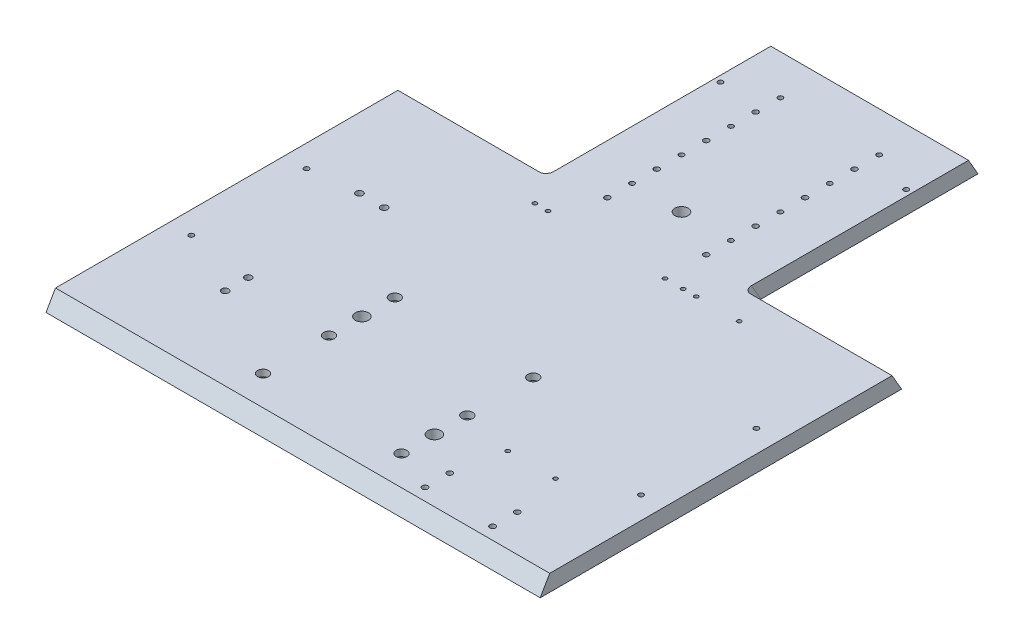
ISO-10303-21;
HEADER;
FILE_DESCRIPTION(('STEP AP214'),'2;1');
FILE_NAME('part.step','',(''),(''),'','','');
FILE_SCHEMA(('AUTOMOTIVE_DESIGN { 1 0 10303 214 1 1 1 1 }'));
ENDSEC;
DATA;
#1=APPLICATION_CONTEXT('core data for automotive mechanical design processes');
#2=APPLICATION_PROTOCOL_DEFINITION('international standard','automotive_design',2000,#1);
#3=PRODUCT_CONTEXT('',#1,'mechanical');
#4=PRODUCT('Part','Part','',(#3));
#5=PRODUCT_RELATED_PRODUCT_CATEGORY('part','',(#4));
#6=PRODUCT_DEFINITION_FORMATION('','',#4);
#7=PRODUCT_DEFINITION_CONTEXT('part definition',#1,'design');
#8=PRODUCT_DEFINITION('design','',#6,#7);
#9=PRODUCT_DEFINITION_SHAPE('','',#8);
#10=(LENGTH_UNIT() NAMED_UNIT(*) SI_UNIT(.MILLI.,.METRE.));
#11=(NAMED_UNIT(*) PLANE_ANGLE_UNIT() SI_UNIT($,.RADIAN.));
#12=(NAMED_UNIT(*) SI_UNIT($,.STERADIAN.) SOLID_ANGLE_UNIT());
#13=UNCERTAINTY_MEASURE_WITH_UNIT(LENGTH_MEASURE(1.E-05),#10,'distance_accuracy_value','');
#14=(GEOMETRIC_REPRESENTATION_CONTEXT(3) GLOBAL_UNCERTAINTY_ASSIGNED_CONTEXT((#13)) GLOBAL_UNIT_ASSIGNED_CONTEXT((#10,
#11,#12)) REPRESENTATION_CONTEXT('',''));
#15=CARTESIAN_POINT('',(0.,0.,0.));
#16=DIRECTION('',(0.,0.,1.));
#17=DIRECTION('',(1.,0.,0.));
#18=AXIS2_PLACEMENT_3D('',#15,#16,#17);
#19=CARTESIAN_POINT('',(0.,0.,0.));
#20=DIRECTION('',(0.,-1.,0.));
#21=DIRECTION('',(0.,0.,-1.));
#22=AXIS2_PLACEMENT_3D('',#19,#20,#21);
#23=PLANE('',#22);
#24=CARTESIAN_POINT('',(41.,0.,40.));
#25=DIRECTION('',(0.,-1.,0.));
#26=DIRECTION('',(0.,0.,-1.));
#27=AXIS2_PLACEMENT_3D('',#24,#25,#26);
#28=CIRCLE('',#27,1.24999999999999);
#29=CARTESIAN_POINT('',(41.,0.,38.75));
#30=VERTEX_POINT('',#29);
#31=EDGE_CURVE('E1327',#30,#30,#28,.T.);
#32=ORIENTED_EDGE('',*,*,#31,.F.);
#33=EDGE_LOOP('',(#32));
#34=FACE_BOUND('',#33,.T.);
#35=CARTESIAN_POINT('',(49.,0.,40.));
#36=DIRECTION('',(0.,-1.,0.));
#37=DIRECTION('',(0.,0.,-1.));
#38=AXIS2_PLACEMENT_3D('',#35,#36,#37);
#39=CIRCLE('',#38,1.24999999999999);
#40=CARTESIAN_POINT('',(49.,0.,38.75));
#41=VERTEX_POINT('',#40);
#42=EDGE_CURVE('E1329',#41,#41,#39,.T.);
#43=ORIENTED_EDGE('',*,*,#42,.F.);
#44=EDGE_LOOP('',(#43));
#45=FACE_BOUND('',#44,.T.);
#46=CARTESIAN_POINT('',(-41.,0.,40.));
#47=DIRECTION('',(0.,-1.,0.));
#48=DIRECTION('',(0.,0.,-1.));
#49=AXIS2_PLACEMENT_3D('',#46,#47,#48);
#50=CIRCLE('',#49,1.24999999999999);
#51=CARTESIAN_POINT('',(-41.,0.,38.75));
#52=VERTEX_POINT('',#51);
#53=EDGE_CURVE('E1337',#52,#52,#50,.T.);
#54=ORIENTED_EDGE('',*,*,#53,.F.);
#55=EDGE_LOOP('',(#54));
#56=FACE_BOUND('',#55,.T.);
#57=CARTESIAN_POINT('',(-49.,0.,40.));
#58=DIRECTION('',(0.,-1.,0.));
#59=DIRECTION('',(0.,0.,-1.));
#60=AXIS2_PLACEMENT_3D('',#57,#58,#59);
#61=CIRCLE('',#60,1.24999999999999);
#62=CARTESIAN_POINT('',(-49.,0.,38.75));
#63=VERTEX_POINT('',#62);
#64=EDGE_CURVE('E1343',#63,#63,#61,.T.);
#65=ORIENTED_EDGE('',*,*,#64,.F.);
#66=EDGE_LOOP('',(#65));
#67=FACE_BOUND('',#66,.T.);
#68=CARTESIAN_POINT('',(75.,0.,40.));
#69=DIRECTION('',(0.,-1.,0.));
#70=DIRECTION('',(0.,0.,-1.));
#71=AXIS2_PLACEMENT_3D('',#68,#69,#70);
#72=CIRCLE('',#71,1.24999999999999);
#73=CARTESIAN_POINT('',(75.,0.,38.75));
#74=VERTEX_POINT('',#73);
#75=EDGE_CURVE('E1349',#74,#74,#72,.T.);
#76=ORIENTED_EDGE('',*,*,#75,.F.);
#77=EDGE_LOOP('',(#76));
#78=FACE_BOUND('',#77,.T.);
#79=CARTESIAN_POINT('',(30.,0.,40.));
#80=DIRECTION('',(0.,-1.,0.));
#81=DIRECTION('',(0.,0.,-1.));
#82=AXIS2_PLACEMENT_3D('',#79,#80,#81);
#83=CIRCLE('',#82,1.24999999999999);
#84=CARTESIAN_POINT('',(30.,0.,38.75));
#85=VERTEX_POINT('',#84);
#86=EDGE_CURVE('E1355',#85,#85,#83,.T.);
#87=ORIENTED_EDGE('',*,*,#86,.F.);
#88=EDGE_LOOP('',(#87));
#89=FACE_BOUND('',#88,.T.);
#90=CARTESIAN_POINT('',(136.5,0.,91.0734488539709));
#91=DIRECTION('',(0.,-1.,0.));
#92=DIRECTION('',(0.,0.,-1.));
#93=AXIS2_PLACEMENT_3D('',#90,#91,#92);
#94=CIRCLE('',#93,1.5);
#95=CARTESIAN_POINT('',(136.5,0.,89.5734488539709));
#96=VERTEX_POINT('',#95);
#97=EDGE_CURVE('E1361',#96,#96,#94,.T.);
#98=ORIENTED_EDGE('',*,*,#97,.F.);
#99=EDGE_LOOP('',(#98));
#100=FACE_BOUND('',#99,.T.);
#101=CARTESIAN_POINT('',(136.5,0.,161.073448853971));
#102=DIRECTION('',(0.,-1.,0.));
#103=DIRECTION('',(0.,0.,-1.));
#104=AXIS2_PLACEMENT_3D('',#101,#102,#103);
#105=CIRCLE('',#104,1.5);
#106=CARTESIAN_POINT('',(136.5,0.,159.573448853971));
#107=VERTEX_POINT('',#106);
#108=EDGE_CURVE('E1367',#107,#107,#105,.T.);
#109=ORIENTED_EDGE('',*,*,#108,.F.);
#110=EDGE_LOOP('',(#109));
#111=FACE_BOUND('',#110,.T.);
#112=CARTESIAN_POINT('',(-136.5,0.,91.0734488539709));
#113=DIRECTION('',(0.,-1.,0.));
#114=DIRECTION('',(0.,0.,-1.));
#115=AXIS2_PLACEMENT_3D('',#112,#113,#114);
#116=CIRCLE('',#115,1.5);
#117=CARTESIAN_POINT('',(-136.5,0.,89.5734488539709));
#118=VERTEX_POINT('',#117);
#119=EDGE_CURVE('E1373',#118,#118,#116,.T.);
#120=ORIENTED_EDGE('',*,*,#119,.F.);
#121=EDGE_LOOP('',(#120));
#122=FACE_BOUND('',#121,.T.);
#123=CARTESIAN_POINT('',(-136.5,0.,161.073448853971));
#124=DIRECTION('',(0.,-1.,0.));
#125=DIRECTION('',(0.,0.,-1.));
#126=AXIS2_PLACEMENT_3D('',#123,#124,#125);
#127=CIRCLE('',#126,1.5);
#128=CARTESIAN_POINT('',(-136.5,0.,159.573448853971));
#129=VERTEX_POINT('',#128);
#130=EDGE_CURVE('E1379',#129,#129,#127,.T.);
#131=ORIENTED_EDGE('',*,*,#130,.F.);
#132=EDGE_LOOP('',(#131));
#133=FACE_BOUND('',#132,.T.);
#134=CARTESIAN_POINT('',(102.,0.,178.476497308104));
#135=DIRECTION('',(0.,-1.,0.));
#136=DIRECTION('',(0.,0.,-1.));
#137=AXIS2_PLACEMENT_3D('',#134,#135,#136);
#138=CIRCLE('',#137,1.24999999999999);
#139=CARTESIAN_POINT('',(102.,0.,177.226497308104));
#140=VERTEX_POINT('',#139);
#141=EDGE_CURVE('E1385',#140,#140,#138,.T.);
#142=ORIENTED_EDGE('',*,*,#141,.F.);
#143=EDGE_LOOP('',(#142));
#144=FACE_BOUND('',#143,.T.);
#145=CARTESIAN_POINT('',(73.,0.,178.476497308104));
#146=DIRECTION('',(0.,-1.,0.));
#147=DIRECTION('',(0.,0.,-1.));
#148=AXIS2_PLACEMENT_3D('',#145,#146,#147);
#149=CIRCLE('',#148,1.24999999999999);
#150=CARTESIAN_POINT('',(73.,0.,177.226497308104));
#151=VERTEX_POINT('',#150);
#152=EDGE_CURVE('E1391',#151,#151,#149,.T.);
#153=ORIENTED_EDGE('',*,*,#152,.F.);
#154=EDGE_LOOP('',(#153));
#155=FACE_BOUND('',#154,.T.);
#156=CARTESIAN_POINT('',(108.,0.,207.675989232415));
#157=DIRECTION('',(0.,-1.,0.));
#158=DIRECTION('',(0.,0.,-1.));
#159=AXIS2_PLACEMENT_3D('',#156,#157,#158);
#160=CIRCLE('',#159,3.15);
#161=CARTESIAN_POINT('',(108.,0.,204.525989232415));
#162=VERTEX_POINT('',#161);
#163=EDGE_CURVE('E1397',#162,#162,#160,.T.);
#164=ORIENTED_EDGE('',*,*,#163,.F.);
#165=EDGE_LOOP('',(#164));
#166=FACE_BOUND('',#165,.T.);
#167=CARTESIAN_POINT('',(108.,0.,222.675989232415));
#168=DIRECTION('',(0.,-1.,0.));
#169=DIRECTION('',(0.,0.,-1.));
#170=AXIS2_PLACEMENT_3D('',#167,#168,#169);
#171=CIRCLE('',#170,3.15);
#172=CARTESIAN_POINT('',(108.,0.,219.525989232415));
#173=VERTEX_POINT('',#172);
#174=EDGE_CURVE('E1406',#173,#173,#171,.T.);
#175=ORIENTED_EDGE('',*,*,#174,.F.);
#176=EDGE_LOOP('',(#175));
#177=FACE_BOUND('',#176,.T.);
#178=CARTESIAN_POINT('',(67.,0.,222.675989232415));
#179=DIRECTION('',(0.,-1.,0.));
#180=DIRECTION('',(0.,0.,-1.));
#181=AXIS2_PLACEMENT_3D('',#178,#179,#180);
#182=CIRCLE('',#181,3.15);
#183=CARTESIAN_POINT('',(67.,0.,219.525989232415));
#184=VERTEX_POINT('',#183);
#185=EDGE_CURVE('E1415',#184,#184,#182,.T.);
#186=ORIENTED_EDGE('',*,*,#185,.F.);
#187=EDGE_LOOP('',(#186));
#188=FACE_BOUND('',#187,.T.);
#189=CARTESIAN_POINT('',(67.,0.,207.675989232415));
#190=DIRECTION('',(0.,-1.,0.));
#191=DIRECTION('',(0.,0.,-1.));
#192=AXIS2_PLACEMENT_3D('',#189,#190,#191);
#193=CIRCLE('',#192,3.15);
#194=CARTESIAN_POINT('',(67.,0.,204.525989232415));
#195=VERTEX_POINT('',#194);
#196=EDGE_CURVE('E1424',#195,#195,#193,.T.);
#197=ORIENTED_EDGE('',*,*,#196,.F.);
#198=EDGE_LOOP('',(#197));
#199=FACE_BOUND('',#198,.T.);
#200=CARTESIAN_POINT('',(30.,0.,-75.));
#201=DIRECTION('',(0.,1.,0.));
#202=DIRECTION('',(0.,0.,1.));
#203=AXIS2_PLACEMENT_3D('',#200,#201,#202);
#204=CIRCLE('',#203,1.65);
#205=CARTESIAN_POINT('',(30.,0.,-73.35));
#206=VERTEX_POINT('',#205);
#207=EDGE_CURVE('E1442',#206,#206,#204,.T.);
#208=ORIENTED_EDGE('',*,*,#207,.T.);
#209=EDGE_LOOP('',(#208));
#210=FACE_BOUND('',#209,.T.);
#211=CARTESIAN_POINT('',(30.,0.,-45.));
#212=DIRECTION('',(0.,1.,0.));
#213=DIRECTION('',(0.,0.,1.));
#214=AXIS2_PLACEMENT_3D('',#211,#212,#213);
#215=CIRCLE('',#214,1.65);
#216=CARTESIAN_POINT('',(30.,0.,-43.35));
#217=VERTEX_POINT('',#216);
#218=EDGE_CURVE('E1454',#217,#217,#215,.T.);
#219=ORIENTED_EDGE('',*,*,#218,.T.);
#220=EDGE_LOOP('',(#219));
#221=FACE_BOUND('',#220,.T.);
#222=CARTESIAN_POINT('',(30.,0.,-15.));
#223=DIRECTION('',(0.,1.,0.));
#224=DIRECTION('',(0.,0.,1.));
#225=AXIS2_PLACEMENT_3D('',#222,#223,#224);
#226=CIRCLE('',#225,1.65);
#227=CARTESIAN_POINT('',(30.,0.,-13.35));
#228=VERTEX_POINT('',#227);
#229=EDGE_CURVE('E1466',#228,#228,#226,.T.);
#230=ORIENTED_EDGE('',*,*,#229,.T.);
#231=EDGE_LOOP('',(#230));
#232=FACE_BOUND('',#231,.T.);
#233=CARTESIAN_POINT('',(30.,0.,-30.));
#234=DIRECTION('',(0.,1.,0.));
#235=DIRECTION('',(0.,0.,1.));
#236=AXIS2_PLACEMENT_3D('',#233,#234,#235);
#237=CIRCLE('',#236,1.5);
#238=CARTESIAN_POINT('',(30.,0.,-28.5));
#239=VERTEX_POINT('',#238);
#240=EDGE_CURVE('E1469',#239,#239,#237,.T.);
#241=ORIENTED_EDGE('',*,*,#240,.T.);
#242=EDGE_LOOP('',(#241));
#243=FACE_BOUND('',#242,.T.);
#244=CARTESIAN_POINT('',(-30.,0.,-30.));
#245=DIRECTION('',(0.,1.,0.));
#246=DIRECTION('',(0.,0.,1.));
#247=AXIS2_PLACEMENT_3D('',#244,#245,#246);
#248=CIRCLE('',#247,1.5);
#249=CARTESIAN_POINT('',(-30.,0.,-28.5));
#250=VERTEX_POINT('',#249);
#251=EDGE_CURVE('E1475',#250,#250,#248,.T.);
#252=ORIENTED_EDGE('',*,*,#251,.T.);
#253=EDGE_LOOP('',(#252));
#254=FACE_BOUND('',#253,.T.);
#255=CARTESIAN_POINT('',(-30.,0.,15.));
#256=DIRECTION('',(0.,1.,0.));
#257=DIRECTION('',(0.,0.,1.));
#258=AXIS2_PLACEMENT_3D('',#255,#256,#257);
#259=CIRCLE('',#258,1.65);
#260=CARTESIAN_POINT('',(-30.,0.,16.65));
#261=VERTEX_POINT('',#260);
#262=EDGE_CURVE('E1484',#261,#261,#259,.T.);
#263=ORIENTED_EDGE('',*,*,#262,.T.);
#264=EDGE_LOOP('',(#263));
#265=FACE_BOUND('',#264,.T.);
#266=CARTESIAN_POINT('',(30.,0.,15.));
#267=DIRECTION('',(0.,1.,0.));
#268=DIRECTION('',(0.,0.,1.));
#269=AXIS2_PLACEMENT_3D('',#266,#267,#268);
#270=CIRCLE('',#269,1.65);
#271=CARTESIAN_POINT('',(30.,0.,16.65));
#272=VERTEX_POINT('',#271);
#273=EDGE_CURVE('E1490',#272,#272,#270,.T.);
#274=ORIENTED_EDGE('',*,*,#273,.T.);
#275=EDGE_LOOP('',(#274));
#276=FACE_BOUND('',#275,.T.);
#277=CARTESIAN_POINT('',(-30.,0.,0.));
#278=DIRECTION('',(0.,1.,0.));
#279=DIRECTION('',(0.,0.,1.));
#280=AXIS2_PLACEMENT_3D('',#277,#278,#279);
#281=CIRCLE('',#280,1.5);
#282=CARTESIAN_POINT('',(-30.,0.,1.5));
#283=VERTEX_POINT('',#282);
#284=EDGE_CURVE('E1496',#283,#283,#281,.T.);
#285=ORIENTED_EDGE('',*,*,#284,.T.);
#286=EDGE_LOOP('',(#285));
#287=FACE_BOUND('',#286,.T.);
#288=CARTESIAN_POINT('',(30.,0.,0.));
#289=DIRECTION('',(0.,1.,0.));
#290=DIRECTION('',(0.,0.,1.));
#291=AXIS2_PLACEMENT_3D('',#288,#289,#290);
#292=CIRCLE('',#291,1.5);
#293=CARTESIAN_POINT('',(30.,0.,1.5));
#294=VERTEX_POINT('',#293);
#295=EDGE_CURVE('E1502',#294,#294,#292,.T.);
#296=ORIENTED_EDGE('',*,*,#295,.T.);
#297=EDGE_LOOP('',(#296));
#298=FACE_BOUND('',#297,.T.);
#299=CARTESIAN_POINT('',(-56.4,0.,-80.));
#300=DIRECTION('',(0.,1.,0.));
#301=DIRECTION('',(0.,0.,1.));
#302=AXIS2_PLACEMENT_3D('',#299,#300,#301);
#303=CIRCLE('',#302,1.5);
#304=CARTESIAN_POINT('',(-56.4,0.,-78.5));
#305=VERTEX_POINT('',#304);
#306=EDGE_CURVE('E1508',#305,#305,#303,.T.);
#307=ORIENTED_EDGE('',*,*,#306,.T.);
#308=EDGE_LOOP('',(#307));
#309=FACE_BOUND('',#308,.T.);
#310=CARTESIAN_POINT('',(56.4,0.,-80.));
#311=DIRECTION('',(0.,1.,0.));
#312=DIRECTION('',(0.,0.,1.));
#313=AXIS2_PLACEMENT_3D('',#310,#311,#312);
#314=CIRCLE('',#313,1.5);
#315=CARTESIAN_POINT('',(56.4,0.,-78.5));
#316=VERTEX_POINT('',#315);
#317=EDGE_CURVE('E145',#316,#316,#314,.T.);
#318=ORIENTED_EDGE('',*,*,#317,.T.);
#319=EDGE_LOOP('',(#318));
#320=FACE_BOUND('',#319,.T.);
#321=CARTESIAN_POINT('',(-140.,0.,220.5));
#322=DIRECTION('',(0.,-1.,0.));
#323=DIRECTION('',(0.,0.,-1.));
#324=AXIS2_PLACEMENT_3D('',#321,#322,#323);
#325=CIRCLE('',#324,1.25);
#326=CARTESIAN_POINT('',(-140.,0.,219.25));
#327=VERTEX_POINT('',#326);
#328=EDGE_CURVE('E139',#327,#327,#325,.T.);
#329=ORIENTED_EDGE('',*,*,#328,.F.);
#330=EDGE_LOOP('',(#329));
#331=FACE_BOUND('',#330,.T.);
#332=CARTESIAN_POINT('',(-140.,0.,31.5));
#333=DIRECTION('',(0.,-1.,0.));
#334=DIRECTION('',(0.,0.,-1.));
#335=AXIS2_PLACEMENT_3D('',#332,#333,#334);
#336=CIRCLE('',#335,1.25);
#337=CARTESIAN_POINT('',(-140.,0.,30.25));
#338=VERTEX_POINT('',#337);
#339=EDGE_CURVE('E138',#338,#338,#336,.T.);
#340=ORIENTED_EDGE('',*,*,#339,.F.);
#341=EDGE_LOOP('',(#340));
#342=FACE_BOUND('',#341,.T.);
#343=CARTESIAN_POINT('',(140.,0.,31.5));
#344=DIRECTION('',(0.,-1.,0.));
#345=DIRECTION('',(0.,0.,-1.));
#346=AXIS2_PLACEMENT_3D('',#343,#344,#345);
#347=CIRCLE('',#346,1.25);
#348=CARTESIAN_POINT('',(140.,0.,30.25));
#349=VERTEX_POINT('',#348);
#350=EDGE_CURVE('E151',#349,#349,#347,.T.);
#351=ORIENTED_EDGE('',*,*,#350,.F.);
#352=EDGE_LOOP('',(#351));
#353=FACE_BOUND('',#352,.T.);
#354=CARTESIAN_POINT('',(140.,0.,220.5));
#355=DIRECTION('',(0.,-1.,0.));
#356=DIRECTION('',(0.,0.,-1.));
#357=AXIS2_PLACEMENT_3D('',#354,#355,#356);
#358=CIRCLE('',#357,1.25);
#359=CARTESIAN_POINT('',(140.,0.,219.25));
#360=VERTEX_POINT('',#359);
#361=EDGE_CURVE('E157',#360,#360,#358,.T.);
#362=ORIENTED_EDGE('',*,*,#361,.F.);
#363=EDGE_LOOP('',(#362));
#364=FACE_BOUND('',#363,.T.);
#365=CARTESIAN_POINT('',(-50.,0.,-105.));
#366=DIRECTION('',(0.,-1.,0.));
#367=DIRECTION('',(0.,0.,-1.));
#368=AXIS2_PLACEMENT_3D('',#365,#366,#367);
#369=CIRCLE('',#368,1.24999999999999);
#370=CARTESIAN_POINT('',(-50.,0.,-106.25));
#371=VERTEX_POINT('',#370);
#372=EDGE_CURVE('E163',#371,#371,#369,.T.);
#373=ORIENTED_EDGE('',*,*,#372,.F.);
#374=EDGE_LOOP('',(#373));
#375=FACE_BOUND('',#374,.T.);
#376=CARTESIAN_POINT('',(50.,0.,-105.));
#377=DIRECTION('',(0.,-1.,0.));
#378=DIRECTION('',(0.,0.,-1.));
#379=AXIS2_PLACEMENT_3D('',#376,#377,#378);
#380=CIRCLE('',#379,1.24999999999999);
#381=CARTESIAN_POINT('',(50.,0.,-106.25));
#382=VERTEX_POINT('',#381);
#383=EDGE_CURVE('E169',#382,#382,#380,.T.);
#384=ORIENTED_EDGE('',*,*,#383,.F.);
#385=EDGE_LOOP('',(#384));
#386=FACE_BOUND('',#385,.T.);
#387=CARTESIAN_POINT('',(-97.,0.,180.));
#388=DIRECTION('',(0.,1.,0.));
#389=DIRECTION('',(0.,0.,1.));
#390=AXIS2_PLACEMENT_3D('',#387,#388,#389);
#391=CIRCLE('',#390,2.1);
#392=CARTESIAN_POINT('',(-97.,0.,182.1));
#393=VERTEX_POINT('',#392);
#394=EDGE_CURVE('E178',#393,#393,#391,.T.);
#395=ORIENTED_EDGE('',*,*,#394,.T.);
#396=EDGE_LOOP('',(#395));
#397=FACE_BOUND('',#396,.T.);
#398=CARTESIAN_POINT('',(-97.,0.,166.));
#399=DIRECTION('',(0.,1.,0.));
#400=DIRECTION('',(0.,0.,1.));
#401=AXIS2_PLACEMENT_3D('',#398,#399,#400);
#402=CIRCLE('',#401,2.1);
#403=CARTESIAN_POINT('',(-97.,0.,168.1));
#404=VERTEX_POINT('',#403);
#405=EDGE_CURVE('E184',#404,#404,#402,.T.);
#406=ORIENTED_EDGE('',*,*,#405,.T.);
#407=EDGE_LOOP('',(#406));
#408=FACE_BOUND('',#407,.T.);
#409=CARTESIAN_POINT('',(-92.5,0.,88.));
#410=DIRECTION('',(0.,1.,0.));
#411=DIRECTION('',(0.,0.,1.));
#412=AXIS2_PLACEMENT_3D('',#409,#410,#411);
#413=CIRCLE('',#412,2.1);
#414=CARTESIAN_POINT('',(-92.5,0.,90.1));
#415=VERTEX_POINT('',#414);
#416=EDGE_CURVE('E190',#415,#415,#413,.T.);
#417=ORIENTED_EDGE('',*,*,#416,.T.);
#418=EDGE_LOOP('',(#417));
#419=FACE_BOUND('',#418,.T.);
#420=CARTESIAN_POINT('',(-107.5,0.,88.));
#421=DIRECTION('',(0.,1.,0.));
#422=DIRECTION('',(0.,0.,1.));
#423=AXIS2_PLACEMENT_3D('',#420,#421,#422);
#424=CIRCLE('',#423,2.1);
#425=CARTESIAN_POINT('',(-107.5,0.,90.1));
#426=VERTEX_POINT('',#425);
#427=EDGE_CURVE('E196',#426,#426,#424,.T.);
#428=ORIENTED_EDGE('',*,*,#427,.T.);
#429=EDGE_LOOP('',(#428));
#430=FACE_BOUND('',#429,.T.);
#431=CARTESIAN_POINT('',(42.,0.,191.996497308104));
#432=DIRECTION('',(0.,-1.,0.));
#433=DIRECTION('',(0.,0.,-1.));
#434=AXIS2_PLACEMENT_3D('',#431,#432,#433);
#435=CIRCLE('',#434,3.99999999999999);
#436=CARTESIAN_POINT('',(42.,0.,187.996497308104));
#437=VERTEX_POINT('',#436);
#438=EDGE_CURVE('E199',#437,#437,#435,.T.);
#439=ORIENTED_EDGE('',*,*,#438,.F.);
#440=EDGE_LOOP('',(#439));
#441=FACE_BOUND('',#440,.T.);
#442=CARTESIAN_POINT('',(-42.,0.,151.996497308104));
#443=DIRECTION('',(0.,-1.,0.));
#444=DIRECTION('',(0.,0.,-1.));
#445=AXIS2_PLACEMENT_3D('',#442,#443,#444);
#446=CIRCLE('',#445,3.99999999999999);
#447=CARTESIAN_POINT('',(-42.,0.,147.996497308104));
#448=VERTEX_POINT('',#447);
#449=EDGE_CURVE('E205',#448,#448,#446,.T.);
#450=ORIENTED_EDGE('',*,*,#449,.F.);
#451=EDGE_LOOP('',(#450));
#452=FACE_BOUND('',#451,.T.);
#453=CARTESIAN_POINT('',(42.,0.,131.996497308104));
#454=DIRECTION('',(0.,-1.,0.));
#455=DIRECTION('',(0.,0.,-1.));
#456=AXIS2_PLACEMENT_3D('',#453,#454,#455);
#457=CIRCLE('',#456,5.5);
#458=CARTESIAN_POINT('',(42.,0.,126.496497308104));
#459=VERTEX_POINT('',#458);
#460=EDGE_CURVE('E211',#459,#459,#457,.T.);
#461=ORIENTED_EDGE('',*,*,#460,.F.);
#462=EDGE_LOOP('',(#461));
#463=FACE_BOUND('',#462,.T.);
#464=CARTESIAN_POINT('',(42.,0.,171.996497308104));
#465=DIRECTION('',(0.,-1.,0.));
#466=DIRECTION('',(0.,0.,-1.));
#467=AXIS2_PLACEMENT_3D('',#464,#465,#466);
#468=CIRCLE('',#467,5.5);
#469=CARTESIAN_POINT('',(42.,0.,166.496497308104));
#470=VERTEX_POINT('',#469);
#471=EDGE_CURVE('E223',#470,#470,#468,.T.);
#472=ORIENTED_EDGE('',*,*,#471,.F.);
#473=EDGE_LOOP('',(#472));
#474=FACE_BOUND('',#473,.T.);
#475=CARTESIAN_POINT('',(42.,0.,211.996497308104));
#476=DIRECTION('',(0.,-1.,0.));
#477=DIRECTION('',(0.,0.,-1.));
#478=AXIS2_PLACEMENT_3D('',#475,#476,#477);
#479=CIRCLE('',#478,5.5);
#480=CARTESIAN_POINT('',(42.,0.,206.496497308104));
#481=VERTEX_POINT('',#480);
#482=EDGE_CURVE('E235',#481,#481,#479,.T.);
#483=ORIENTED_EDGE('',*,*,#482,.F.);
#484=EDGE_LOOP('',(#483));
#485=FACE_BOUND('',#484,.T.);
#486=CARTESIAN_POINT('',(-42.,0.,171.996497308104));
#487=DIRECTION('',(0.,-1.,0.));
#488=DIRECTION('',(0.,0.,-1.));
#489=AXIS2_PLACEMENT_3D('',#486,#487,#488);
#490=CIRCLE('',#489,5.5);
#491=CARTESIAN_POINT('',(-42.,0.,166.496497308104));
#492=VERTEX_POINT('',#491);
#493=EDGE_CURVE('E247',#492,#492,#490,.T.);
#494=ORIENTED_EDGE('',*,*,#493,.F.);
#495=EDGE_LOOP('',(#494));
#496=FACE_BOUND('',#495,.T.);
#497=CARTESIAN_POINT('',(-42.,0.,131.996497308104));
#498=DIRECTION('',(0.,-1.,0.));
#499=DIRECTION('',(0.,0.,-1.));
#500=AXIS2_PLACEMENT_3D('',#497,#498,#499);
#501=CIRCLE('',#500,5.5);
#502=CARTESIAN_POINT('',(-42.,0.,126.496497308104));
#503=VERTEX_POINT('',#502);
#504=EDGE_CURVE('E259',#503,#503,#501,.T.);
#505=ORIENTED_EDGE('',*,*,#504,.F.);
#506=EDGE_LOOP('',(#505));
#507=FACE_BOUND('',#506,.T.);
#508=CARTESIAN_POINT('',(-42.,0.,211.996497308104));
#509=DIRECTION('',(0.,-1.,0.));
#510=DIRECTION('',(0.,0.,-1.));
#511=AXIS2_PLACEMENT_3D('',#508,#509,#510);
#512=CIRCLE('',#511,5.5);
#513=CARTESIAN_POINT('',(-42.,0.,206.496497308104));
#514=VERTEX_POINT('',#513);
#515=EDGE_CURVE('E271',#514,#514,#512,.T.);
#516=ORIENTED_EDGE('',*,*,#515,.F.);
#517=EDGE_LOOP('',(#516));
#518=FACE_BOUND('',#517,.T.);
#519=CARTESIAN_POINT('',(0.,0.,0.));
#520=DIRECTION('',(0.,1.,0.));
#521=DIRECTION('',(0.,0.,1.));
#522=AXIS2_PLACEMENT_3D('',#519,#520,#521);
#523=CIRCLE('',#522,4.);
#524=CARTESIAN_POINT('',(0.,0.,4.));
#525=VERTEX_POINT('',#524);
#526=EDGE_CURVE('E284',#525,#525,#523,.T.);
#527=ORIENTED_EDGE('',*,*,#526,.T.);
#528=EDGE_LOOP('',(#527));
#529=FACE_BOUND('',#528,.T.);
#530=DIRECTION('',(0.,0.,1.));
#531=VECTOR('',#530,1.);
#532=CARTESIAN_POINT('',(-60.,0.,16.38));
#533=LINE('',#532,#531);
#534=CARTESIAN_POINT('',(-60.,0.,-120.));
#535=VERTEX_POINT('',#534);
#536=CARTESIAN_POINT('',(-60.,0.,11.761197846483));
#537=VERTEX_POINT('',#536);
#538=EDGE_CURVE('E287',#535,#537,#533,.T.);
#539=ORIENTED_EDGE('',*,*,#538,.F.);
#540=DIRECTION('',(-1.,0.,0.));
#541=VECTOR('',#540,1.);
#542=CARTESIAN_POINT('',(-60.,0.,-120.));
#543=LINE('',#542,#541);
#544=CARTESIAN_POINT('',(60.,0.,-120.));
#545=VERTEX_POINT('',#544);
#546=EDGE_CURVE('E293',#545,#535,#543,.T.);
#547=ORIENTED_EDGE('',*,*,#546,.F.);
#548=DIRECTION('',(0.,0.,-1.));
#549=VECTOR('',#548,1.);
#550=CARTESIAN_POINT('',(60.,0.,-120.));
#551=LINE('',#550,#549);
#552=CARTESIAN_POINT('',(60.,0.,11.7611978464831));
#553=VERTEX_POINT('',#552);
#554=EDGE_CURVE('E315',#553,#545,#551,.T.);
#555=ORIENTED_EDGE('',*,*,#554,.F.);
#556=CARTESIAN_POINT('',(64.,0.,11.761197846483));
#557=DIRECTION('',(0.,-1.,0.));
#558=DIRECTION('',(0.,0.,1.));
#559=AXIS2_PLACEMENT_3D('',#556,#557,#558);
#560=ELLIPSE('',#559,4.618802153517,4.);
#561=CARTESIAN_POINT('',(64.,0.,16.38));
#562=VERTEX_POINT('',#561);
#563=EDGE_CURVE('E377',#553,#562,#560,.F.);
#564=ORIENTED_EDGE('',*,*,#563,.T.);
#565=DIRECTION('',(-1.,0.,0.));
#566=VECTOR('',#565,1.);
#567=CARTESIAN_POINT('',(60.,0.,16.38));
#568=LINE('',#567,#566);
#569=CARTESIAN_POINT('',(150.,0.,16.38));
#570=VERTEX_POINT('',#569);
#571=EDGE_CURVE('E312',#570,#562,#568,.T.);
#572=ORIENTED_EDGE('',*,*,#571,.F.);
#573=DIRECTION('',(0.,0.,-1.));
#574=VECTOR('',#573,1.);
#575=CARTESIAN_POINT('',(150.,0.,16.38));
#576=LINE('',#575,#574);
#577=CARTESIAN_POINT('',(150.,0.,235.77));
#578=VERTEX_POINT('',#577);
#579=EDGE_CURVE('E310',#578,#570,#576,.T.);
#580=ORIENTED_EDGE('',*,*,#579,.F.);
#581=DIRECTION('',(1.,0.,0.));
#582=VECTOR('',#581,1.);
#583=CARTESIAN_POINT('',(150.,0.,235.77));
#584=LINE('',#583,#582);
#585=CARTESIAN_POINT('',(-150.,0.,235.77));
#586=VERTEX_POINT('',#585);
#587=EDGE_CURVE('E307',#586,#578,#584,.T.);
#588=ORIENTED_EDGE('',*,*,#587,.F.);
#589=DIRECTION('',(0.,0.,1.));
#590=VECTOR('',#589,1.);
#591=CARTESIAN_POINT('',(-150.,0.,235.77));
#592=LINE('',#591,#590);
#593=CARTESIAN_POINT('',(-150.,0.,16.38));
#594=VERTEX_POINT('',#593);
#595=EDGE_CURVE('E305',#594,#586,#592,.T.);
#596=ORIENTED_EDGE('',*,*,#595,.F.);
#597=DIRECTION('',(-1.,0.,0.));
#598=VECTOR('',#597,1.);
#599=CARTESIAN_POINT('',(-150.,0.,16.38));
#600=LINE('',#599,#598);
#601=CARTESIAN_POINT('',(-64.,0.,16.38));
#602=VERTEX_POINT('',#601);
#603=EDGE_CURVE('E303',#602,#594,#600,.T.);
#604=ORIENTED_EDGE('',*,*,#603,.F.);
#605=CARTESIAN_POINT('',(-64.,0.,11.761197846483));
#606=DIRECTION('',(0.,-1.,0.));
#607=DIRECTION('',(0.,0.,-1.));
#608=AXIS2_PLACEMENT_3D('',#605,#606,#607);
#609=ELLIPSE('',#608,4.618802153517,4.);
#610=EDGE_CURVE('E11',#602,#537,#609,.F.);
#611=ORIENTED_EDGE('',*,*,#610,.T.);
#612=EDGE_LOOP('',(#539,#547,#555,#564,#572,#580,#588,#596,#604,#611));
#613=FACE_BOUND('',#612,.T.);
#614=CARTESIAN_POINT('',(-30.,0.,-60.));
#615=DIRECTION('',(0.,1.,0.));
#616=DIRECTION('',(0.,0.,1.));
#617=AXIS2_PLACEMENT_3D('',#614,#615,#616);
#618=CIRCLE('',#617,1.5);
#619=CARTESIAN_POINT('',(-30.,0.,-58.5));
#620=VERTEX_POINT('',#619);
#621=EDGE_CURVE('E344',#620,#620,#618,.T.);
#622=ORIENTED_EDGE('',*,*,#621,.T.);
#623=EDGE_LOOP('',(#622));
#624=FACE_BOUND('',#623,.T.);
#625=CARTESIAN_POINT('',(-30.,0.,-90.));
#626=DIRECTION('',(0.,1.,0.));
#627=DIRECTION('',(0.,0.,1.));
#628=AXIS2_PLACEMENT_3D('',#625,#626,#627);
#629=CIRCLE('',#628,1.5);
#630=CARTESIAN_POINT('',(-30.,0.,-88.5));
#631=VERTEX_POINT('',#630);
#632=EDGE_CURVE('E350',#631,#631,#629,.T.);
#633=ORIENTED_EDGE('',*,*,#632,.T.);
#634=EDGE_LOOP('',(#633));
#635=FACE_BOUND('',#634,.T.);
#636=CARTESIAN_POINT('',(30.,0.,-60.));
#637=DIRECTION('',(0.,1.,0.));
#638=DIRECTION('',(0.,0.,1.));
#639=AXIS2_PLACEMENT_3D('',#636,#637,#638);
#640=CIRCLE('',#639,1.5);
#641=CARTESIAN_POINT('',(30.,0.,-58.5));
#642=VERTEX_POINT('',#641);
#643=EDGE_CURVE('E356',#642,#642,#640,.T.);
#644=ORIENTED_EDGE('',*,*,#643,.T.);
#645=EDGE_LOOP('',(#644));
#646=FACE_BOUND('',#645,.T.);
#647=CARTESIAN_POINT('',(30.,0.,-90.));
#648=DIRECTION('',(0.,1.,0.));
#649=DIRECTION('',(0.,0.,1.));
#650=AXIS2_PLACEMENT_3D('',#647,#648,#649);
#651=CIRCLE('',#650,1.5);
#652=CARTESIAN_POINT('',(30.,0.,-88.5));
#653=VERTEX_POINT('',#652);
#654=EDGE_CURVE('E362',#653,#653,#651,.T.);
#655=ORIENTED_EDGE('',*,*,#654,.T.);
#656=EDGE_LOOP('',(#655));
#657=FACE_BOUND('',#656,.T.);
#658=CARTESIAN_POINT('',(-30.,0.,-15.));
#659=DIRECTION('',(0.,1.,0.));
#660=DIRECTION('',(0.,0.,1.));
#661=AXIS2_PLACEMENT_3D('',#658,#659,#660);
#662=CIRCLE('',#661,1.65);
#663=CARTESIAN_POINT('',(-30.,0.,-13.35));
#664=VERTEX_POINT('',#663);
#665=EDGE_CURVE('E1460',#664,#664,#662,.T.);
#666=ORIENTED_EDGE('',*,*,#665,.T.);
#667=EDGE_LOOP('',(#666));
#668=FACE_BOUND('',#667,.T.);
#669=CARTESIAN_POINT('',(-30.,0.,-45.));
#670=DIRECTION('',(0.,1.,0.));
#671=DIRECTION('',(0.,0.,1.));
#672=AXIS2_PLACEMENT_3D('',#669,#670,#671);
#673=CIRCLE('',#672,1.65);
#674=CARTESIAN_POINT('',(-30.,0.,-43.35));
#675=VERTEX_POINT('',#674);
#676=EDGE_CURVE('E1448',#675,#675,#673,.T.);
#677=ORIENTED_EDGE('',*,*,#676,.T.);
#678=EDGE_LOOP('',(#677));
#679=FACE_BOUND('',#678,.T.);
#680=CARTESIAN_POINT('',(-30.,0.,-75.));
#681=DIRECTION('',(0.,1.,0.));
#682=DIRECTION('',(0.,0.,1.));
#683=AXIS2_PLACEMENT_3D('',#680,#681,#682);
#684=CIRCLE('',#683,1.65);
#685=CARTESIAN_POINT('',(-30.,0.,-73.35));
#686=VERTEX_POINT('',#685);
#687=EDGE_CURVE('E1436',#686,#686,#684,.T.);
#688=ORIENTED_EDGE('',*,*,#687,.T.);
#689=EDGE_LOOP('',(#688));
#690=FACE_BOUND('',#689,.T.);
#691=ADVANCED_FACE('F37',(#34,#45,#56,#67,#78,#89,#100,#111,#122,#133,#144,#155,#166,#177,#188,
#199,#210,#221,#232,#243,#254,#265,#276,#287,#298,#309,#320,#331,#342,#353,#364,#375,#386,#397,
#408,#419,#430,#441,#452,#463,#474,#485,#496,#507,#518,#529,#613,#624,#635,#646,#657,#668,#679,
#690),#23,.T.);
#692=CARTESIAN_POINT('',(0.,10.,0.));
#693=DIRECTION('',(0.,-1.,0.));
#694=DIRECTION('',(0.,0.,-1.));
#695=AXIS2_PLACEMENT_3D('',#692,#693,#694);
#696=PLANE('',#695);
#697=CARTESIAN_POINT('',(41.,10.,40.));
#698=DIRECTION('',(0.,-1.,0.));
#699=DIRECTION('',(0.,0.,-1.));
#700=AXIS2_PLACEMENT_3D('',#697,#698,#699);
#701=CIRCLE('',#700,1.24999999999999);
#702=CARTESIAN_POINT('',(41.,10.,38.75));
#703=VERTEX_POINT('',#702);
#704=EDGE_CURVE('E1325',#703,#703,#701,.T.);
#705=ORIENTED_EDGE('',*,*,#704,.T.);
#706=EDGE_LOOP('',(#705));
#707=FACE_BOUND('',#706,.T.);
#708=CARTESIAN_POINT('',(49.,10.,40.));
#709=DIRECTION('',(0.,-1.,0.));
#710=DIRECTION('',(0.,0.,-1.));
#711=AXIS2_PLACEMENT_3D('',#708,#709,#710);
#712=CIRCLE('',#711,1.25);
#713=CARTESIAN_POINT('',(49.,10.,38.75));
#714=VERTEX_POINT('',#713);
#715=EDGE_CURVE('E1334',#714,#714,#712,.T.);
#716=ORIENTED_EDGE('',*,*,#715,.T.);
#717=EDGE_LOOP('',(#716));
#718=FACE_BOUND('',#717,.T.);
#719=CARTESIAN_POINT('',(-41.,10.,40.));
#720=DIRECTION('',(0.,-1.,0.));
#721=DIRECTION('',(0.,0.,-1.));
#722=AXIS2_PLACEMENT_3D('',#719,#720,#721);
#723=CIRCLE('',#722,1.24999999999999);
#724=CARTESIAN_POINT('',(-41.,10.,38.75));
#725=VERTEX_POINT('',#724);
#726=EDGE_CURVE('E1340',#725,#725,#723,.T.);
#727=ORIENTED_EDGE('',*,*,#726,.T.);
#728=EDGE_LOOP('',(#727));
#729=FACE_BOUND('',#728,.T.);
#730=CARTESIAN_POINT('',(-49.,10.,40.));
#731=DIRECTION('',(0.,-1.,0.));
#732=DIRECTION('',(0.,0.,-1.));
#733=AXIS2_PLACEMENT_3D('',#730,#731,#732);
#734=CIRCLE('',#733,1.25);
#735=CARTESIAN_POINT('',(-49.,10.,38.75));
#736=VERTEX_POINT('',#735);
#737=EDGE_CURVE('E1346',#736,#736,#734,.T.);
#738=ORIENTED_EDGE('',*,*,#737,.T.);
#739=EDGE_LOOP('',(#738));
#740=FACE_BOUND('',#739,.T.);
#741=CARTESIAN_POINT('',(75.,10.,40.));
#742=DIRECTION('',(0.,-1.,0.));
#743=DIRECTION('',(0.,0.,-1.));
#744=AXIS2_PLACEMENT_3D('',#741,#742,#743);
#745=CIRCLE('',#744,1.25);
#746=CARTESIAN_POINT('',(75.,10.,38.75));
#747=VERTEX_POINT('',#746);
#748=EDGE_CURVE('E1352',#747,#747,#745,.T.);
#749=ORIENTED_EDGE('',*,*,#748,.T.);
#750=EDGE_LOOP('',(#749));
#751=FACE_BOUND('',#750,.T.);
#752=CARTESIAN_POINT('',(30.,10.,40.));
#753=DIRECTION('',(0.,-1.,0.));
#754=DIRECTION('',(0.,0.,-1.));
#755=AXIS2_PLACEMENT_3D('',#752,#753,#754);
#756=CIRCLE('',#755,1.25);
#757=CARTESIAN_POINT('',(30.,10.,38.75));
#758=VERTEX_POINT('',#757);
#759=EDGE_CURVE('E1358',#758,#758,#756,.T.);
#760=ORIENTED_EDGE('',*,*,#759,.T.);
#761=EDGE_LOOP('',(#760));
#762=FACE_BOUND('',#761,.T.);
#763=CARTESIAN_POINT('',(136.5,9.99999999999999,91.0734488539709));
#764=DIRECTION('',(0.,-1.,0.));
#765=DIRECTION('',(0.,0.,-1.));
#766=AXIS2_PLACEMENT_3D('',#763,#764,#765);
#767=CIRCLE('',#766,1.49999999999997);
#768=CARTESIAN_POINT('',(136.5,9.99999999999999,89.5734488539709));
#769=VERTEX_POINT('',#768);
#770=EDGE_CURVE('E1364',#769,#769,#767,.T.);
#771=ORIENTED_EDGE('',*,*,#770,.T.);
#772=EDGE_LOOP('',(#771));
#773=FACE_BOUND('',#772,.T.);
#774=CARTESIAN_POINT('',(136.5,9.99999999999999,161.073448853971));
#775=DIRECTION('',(0.,-1.,0.));
#776=DIRECTION('',(0.,0.,-1.));
#777=AXIS2_PLACEMENT_3D('',#774,#775,#776);
#778=CIRCLE('',#777,1.49999999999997);
#779=CARTESIAN_POINT('',(136.5,9.99999999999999,159.573448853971));
#780=VERTEX_POINT('',#779);
#781=EDGE_CURVE('E1370',#780,#780,#778,.T.);
#782=ORIENTED_EDGE('',*,*,#781,.T.);
#783=EDGE_LOOP('',(#782));
#784=FACE_BOUND('',#783,.T.);
#785=CARTESIAN_POINT('',(-136.5,9.99999999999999,91.0734488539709));
#786=DIRECTION('',(0.,-1.,0.));
#787=DIRECTION('',(0.,0.,-1.));
#788=AXIS2_PLACEMENT_3D('',#785,#786,#787);
#789=CIRCLE('',#788,1.49999999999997);
#790=CARTESIAN_POINT('',(-136.5,9.99999999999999,89.5734488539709));
#791=VERTEX_POINT('',#790);
#792=EDGE_CURVE('E1376',#791,#791,#789,.T.);
#793=ORIENTED_EDGE('',*,*,#792,.T.);
#794=EDGE_LOOP('',(#793));
#795=FACE_BOUND('',#794,.T.);
#796=CARTESIAN_POINT('',(-136.5,9.99999999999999,161.073448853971));
#797=DIRECTION('',(0.,-1.,0.));
#798=DIRECTION('',(0.,0.,-1.));
#799=AXIS2_PLACEMENT_3D('',#796,#797,#798);
#800=CIRCLE('',#799,1.49999999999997);
#801=CARTESIAN_POINT('',(-136.5,9.99999999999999,159.573448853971));
#802=VERTEX_POINT('',#801);
#803=EDGE_CURVE('E1382',#802,#802,#800,.T.);
#804=ORIENTED_EDGE('',*,*,#803,.T.);
#805=EDGE_LOOP('',(#804));
#806=FACE_BOUND('',#805,.T.);
#807=CARTESIAN_POINT('',(102.,10.,178.476497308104));
#808=DIRECTION('',(0.,-1.,0.));
#809=DIRECTION('',(0.,0.,-1.));
#810=AXIS2_PLACEMENT_3D('',#807,#808,#809);
#811=CIRCLE('',#810,1.25);
#812=CARTESIAN_POINT('',(102.,10.,177.226497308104));
#813=VERTEX_POINT('',#812);
#814=EDGE_CURVE('E1388',#813,#813,#811,.T.);
#815=ORIENTED_EDGE('',*,*,#814,.T.);
#816=EDGE_LOOP('',(#815));
#817=FACE_BOUND('',#816,.T.);
#818=CARTESIAN_POINT('',(73.,10.,178.476497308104));
#819=DIRECTION('',(0.,-1.,0.));
#820=DIRECTION('',(0.,0.,-1.));
#821=AXIS2_PLACEMENT_3D('',#818,#819,#820);
#822=CIRCLE('',#821,1.25);
#823=CARTESIAN_POINT('',(73.,10.,177.226497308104));
#824=VERTEX_POINT('',#823);
#825=EDGE_CURVE('E1394',#824,#824,#822,.T.);
#826=ORIENTED_EDGE('',*,*,#825,.T.);
#827=EDGE_LOOP('',(#826));
#828=FACE_BOUND('',#827,.T.);
#829=CARTESIAN_POINT('',(108.,10.,207.675989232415));
#830=DIRECTION('',(0.,-1.,0.));
#831=DIRECTION('',(0.,0.,-1.));
#832=AXIS2_PLACEMENT_3D('',#829,#830,#831);
#833=CIRCLE('',#832,1.69999999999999);
#834=CARTESIAN_POINT('',(108.,10.,205.975989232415));
#835=VERTEX_POINT('',#834);
#836=EDGE_CURVE('E1403',#835,#835,#833,.T.);
#837=ORIENTED_EDGE('',*,*,#836,.T.);
#838=EDGE_LOOP('',(#837));
#839=FACE_BOUND('',#838,.T.);
#840=CARTESIAN_POINT('',(108.,10.,222.675989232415));
#841=DIRECTION('',(0.,-1.,0.));
#842=DIRECTION('',(0.,0.,-1.));
#843=AXIS2_PLACEMENT_3D('',#840,#841,#842);
#844=CIRCLE('',#843,1.69999999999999);
#845=CARTESIAN_POINT('',(108.,10.,220.975989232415));
#846=VERTEX_POINT('',#845);
#847=EDGE_CURVE('E1412',#846,#846,#844,.T.);
#848=ORIENTED_EDGE('',*,*,#847,.T.);
#849=EDGE_LOOP('',(#848));
#850=FACE_BOUND('',#849,.T.);
#851=CARTESIAN_POINT('',(67.,10.,222.675989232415));
#852=DIRECTION('',(0.,-1.,0.));
#853=DIRECTION('',(0.,0.,-1.));
#854=AXIS2_PLACEMENT_3D('',#851,#852,#853);
#855=CIRCLE('',#854,1.69999999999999);
#856=CARTESIAN_POINT('',(67.,10.,220.975989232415));
#857=VERTEX_POINT('',#856);
#858=EDGE_CURVE('E1421',#857,#857,#855,.T.);
#859=ORIENTED_EDGE('',*,*,#858,.T.);
#860=EDGE_LOOP('',(#859));
#861=FACE_BOUND('',#860,.T.);
#862=CARTESIAN_POINT('',(67.,10.,207.675989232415));
#863=DIRECTION('',(0.,-1.,0.));
#864=DIRECTION('',(0.,0.,-1.));
#865=AXIS2_PLACEMENT_3D('',#862,#863,#864);
#866=CIRCLE('',#865,1.69999999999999);
#867=CARTESIAN_POINT('',(67.,10.,205.975989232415));
#868=VERTEX_POINT('',#867);
#869=EDGE_CURVE('E1430',#868,#868,#866,.T.);
#870=ORIENTED_EDGE('',*,*,#869,.T.);
#871=EDGE_LOOP('',(#870));
#872=FACE_BOUND('',#871,.T.);
#873=CARTESIAN_POINT('',(30.,10.,-75.));
#874=DIRECTION('',(0.,1.,0.));
#875=DIRECTION('',(0.,0.,1.));
#876=AXIS2_PLACEMENT_3D('',#873,#874,#875);
#877=CIRCLE('',#876,1.65);
#878=CARTESIAN_POINT('',(30.,10.,-73.35));
#879=VERTEX_POINT('',#878);
#880=EDGE_CURVE('E1439',#879,#879,#877,.T.);
#881=ORIENTED_EDGE('',*,*,#880,.F.);
#882=EDGE_LOOP('',(#881));
#883=FACE_BOUND('',#882,.T.);
#884=CARTESIAN_POINT('',(-30.,10.,-15.));
#885=DIRECTION('',(0.,1.,0.));
#886=DIRECTION('',(0.,0.,1.));
#887=AXIS2_PLACEMENT_3D('',#884,#885,#886);
#888=CIRCLE('',#887,1.65);
#889=CARTESIAN_POINT('',(-30.,10.,-13.35));
#890=VERTEX_POINT('',#889);
#891=EDGE_CURVE('E1457',#890,#890,#888,.T.);
#892=ORIENTED_EDGE('',*,*,#891,.F.);
#893=EDGE_LOOP('',(#892));
#894=FACE_BOUND('',#893,.T.);
#895=CARTESIAN_POINT('',(30.,10.,-15.));
#896=DIRECTION('',(0.,1.,0.));
#897=DIRECTION('',(0.,0.,1.));
#898=AXIS2_PLACEMENT_3D('',#895,#896,#897);
#899=CIRCLE('',#898,1.65);
#900=CARTESIAN_POINT('',(30.,10.,-13.35));
#901=VERTEX_POINT('',#900);
#902=EDGE_CURVE('E1463',#901,#901,#899,.T.);
#903=ORIENTED_EDGE('',*,*,#902,.F.);
#904=EDGE_LOOP('',(#903));
#905=FACE_BOUND('',#904,.T.);
#906=CARTESIAN_POINT('',(30.,10.,-30.));
#907=DIRECTION('',(0.,1.,0.));
#908=DIRECTION('',(0.,0.,1.));
#909=AXIS2_PLACEMENT_3D('',#906,#907,#908);
#910=CIRCLE('',#909,1.49999999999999);
#911=CARTESIAN_POINT('',(30.,10.,-28.5));
#912=VERTEX_POINT('',#911);
#913=EDGE_CURVE('E1472',#912,#912,#910,.T.);
#914=ORIENTED_EDGE('',*,*,#913,.F.);
#915=EDGE_LOOP('',(#914));
#916=FACE_BOUND('',#915,.T.);
#917=CARTESIAN_POINT('',(-30.,10.,-30.));
#918=DIRECTION('',(0.,1.,0.));
#919=DIRECTION('',(0.,0.,1.));
#920=AXIS2_PLACEMENT_3D('',#917,#918,#919);
#921=CIRCLE('',#920,1.49999999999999);
#922=CARTESIAN_POINT('',(-30.,10.,-28.5));
#923=VERTEX_POINT('',#922);
#924=EDGE_CURVE('E1478',#923,#923,#921,.T.);
#925=ORIENTED_EDGE('',*,*,#924,.F.);
#926=EDGE_LOOP('',(#925));
#927=FACE_BOUND('',#926,.T.);
#928=CARTESIAN_POINT('',(-30.,10.,15.));
#929=DIRECTION('',(0.,1.,0.));
#930=DIRECTION('',(0.,0.,1.));
#931=AXIS2_PLACEMENT_3D('',#928,#929,#930);
#932=CIRCLE('',#931,1.65);
#933=CARTESIAN_POINT('',(-30.,10.,16.65));
#934=VERTEX_POINT('',#933);
#935=EDGE_CURVE('E1481',#934,#934,#932,.T.);
#936=ORIENTED_EDGE('',*,*,#935,.F.);
#937=EDGE_LOOP('',(#936));
#938=FACE_BOUND('',#937,.T.);
#939=CARTESIAN_POINT('',(30.,10.,15.));
#940=DIRECTION('',(0.,1.,0.));
#941=DIRECTION('',(0.,0.,1.));
#942=AXIS2_PLACEMENT_3D('',#939,#940,#941);
#943=CIRCLE('',#942,1.65);
#944=CARTESIAN_POINT('',(30.,10.,16.65));
#945=VERTEX_POINT('',#944);
#946=EDGE_CURVE('E1487',#945,#945,#943,.T.);
#947=ORIENTED_EDGE('',*,*,#946,.F.);
#948=EDGE_LOOP('',(#947));
#949=FACE_BOUND('',#948,.T.);
#950=CARTESIAN_POINT('',(-30.,10.,0.));
#951=DIRECTION('',(0.,1.,0.));
#952=DIRECTION('',(0.,0.,1.));
#953=AXIS2_PLACEMENT_3D('',#950,#951,#952);
#954=CIRCLE('',#953,1.49999999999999);
#955=CARTESIAN_POINT('',(-30.,10.,1.49999999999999));
#956=VERTEX_POINT('',#955);
#957=EDGE_CURVE('E1493',#956,#956,#954,.T.);
#958=ORIENTED_EDGE('',*,*,#957,.F.);
#959=EDGE_LOOP('',(#958));
#960=FACE_BOUND('',#959,.T.);
#961=CARTESIAN_POINT('',(30.,10.,0.));
#962=DIRECTION('',(0.,1.,0.));
#963=DIRECTION('',(0.,0.,1.));
#964=AXIS2_PLACEMENT_3D('',#961,#962,#963);
#965=CIRCLE('',#964,1.49999999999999);
#966=CARTESIAN_POINT('',(30.,10.,1.49999999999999));
#967=VERTEX_POINT('',#966);
#968=EDGE_CURVE('E1499',#967,#967,#965,.T.);
#969=ORIENTED_EDGE('',*,*,#968,.F.);
#970=EDGE_LOOP('',(#969));
#971=FACE_BOUND('',#970,.T.);
#972=CARTESIAN_POINT('',(-56.4,10.,-80.));
#973=DIRECTION('',(0.,1.,0.));
#974=DIRECTION('',(0.,0.,1.));
#975=AXIS2_PLACEMENT_3D('',#972,#973,#974);
#976=CIRCLE('',#975,1.49999999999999);
#977=CARTESIAN_POINT('',(-56.4,10.,-78.5));
#978=VERTEX_POINT('',#977);
#979=EDGE_CURVE('E1505',#978,#978,#976,.T.);
#980=ORIENTED_EDGE('',*,*,#979,.F.);
#981=EDGE_LOOP('',(#980));
#982=FACE_BOUND('',#981,.T.);
#983=CARTESIAN_POINT('',(56.4,10.,-80.));
#984=DIRECTION('',(0.,1.,0.));
#985=DIRECTION('',(0.,0.,1.));
#986=AXIS2_PLACEMENT_3D('',#983,#984,#985);
#987=CIRCLE('',#986,1.49999999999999);
#988=CARTESIAN_POINT('',(56.4,10.,-78.5));
#989=VERTEX_POINT('',#988);
#990=EDGE_CURVE('E1511',#989,#989,#987,.T.);
#991=ORIENTED_EDGE('',*,*,#990,.F.);
#992=EDGE_LOOP('',(#991));
#993=FACE_BOUND('',#992,.T.);
#994=CARTESIAN_POINT('',(-97.,10.,180.));
#995=DIRECTION('',(0.,1.,0.));
#996=DIRECTION('',(0.,0.,1.));
#997=AXIS2_PLACEMENT_3D('',#994,#995,#996);
#998=CIRCLE('',#997,2.1);
#999=CARTESIAN_POINT('',(-97.,10.,182.1));
#1000=VERTEX_POINT('',#999);
#1001=EDGE_CURVE('E175',#1000,#1000,#998,.T.);
#1002=ORIENTED_EDGE('',*,*,#1001,.F.);
#1003=EDGE_LOOP('',(#1002));
#1004=FACE_BOUND('',#1003,.T.);
#1005=CARTESIAN_POINT('',(-97.,10.,166.));
#1006=DIRECTION('',(0.,1.,0.));
#1007=DIRECTION('',(0.,0.,1.));
#1008=AXIS2_PLACEMENT_3D('',#1005,#1006,#1007);
#1009=CIRCLE('',#1008,2.1);
#1010=CARTESIAN_POINT('',(-97.,10.,168.1));
#1011=VERTEX_POINT('',#1010);
#1012=EDGE_CURVE('E181',#1011,#1011,#1009,.T.);
#1013=ORIENTED_EDGE('',*,*,#1012,.F.);
#1014=EDGE_LOOP('',(#1013));
#1015=FACE_BOUND('',#1014,.T.);
#1016=CARTESIAN_POINT('',(-92.5,10.,88.));
#1017=DIRECTION('',(0.,1.,0.));
#1018=DIRECTION('',(0.,0.,1.));
#1019=AXIS2_PLACEMENT_3D('',#1016,#1017,#1018);
#1020=CIRCLE('',#1019,2.1);
#1021=CARTESIAN_POINT('',(-92.5,10.,90.1));
#1022=VERTEX_POINT('',#1021);
#1023=EDGE_CURVE('E187',#1022,#1022,#1020,.T.);
#1024=ORIENTED_EDGE('',*,*,#1023,.F.);
#1025=EDGE_LOOP('',(#1024));
#1026=FACE_BOUND('',#1025,.T.);
#1027=CARTESIAN_POINT('',(-107.5,10.,88.));
#1028=DIRECTION('',(0.,1.,0.));
#1029=DIRECTION('',(0.,0.,1.));
#1030=AXIS2_PLACEMENT_3D('',#1027,#1028,#1029);
#1031=CIRCLE('',#1030,2.1);
#1032=CARTESIAN_POINT('',(-107.5,10.,90.1));
#1033=VERTEX_POINT('',#1032);
#1034=EDGE_CURVE('E193',#1033,#1033,#1031,.T.);
#1035=ORIENTED_EDGE('',*,*,#1034,.F.);
#1036=EDGE_LOOP('',(#1035));
#1037=FACE_BOUND('',#1036,.T.);
#1038=CARTESIAN_POINT('',(42.,10.,191.996497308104));
#1039=DIRECTION('',(0.,-1.,0.));
#1040=DIRECTION('',(0.,0.,-1.));
#1041=AXIS2_PLACEMENT_3D('',#1038,#1039,#1040);
#1042=CIRCLE('',#1041,4.);
#1043=CARTESIAN_POINT('',(42.,10.,187.996497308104));
#1044=VERTEX_POINT('',#1043);
#1045=EDGE_CURVE('E202',#1044,#1044,#1042,.T.);
#1046=ORIENTED_EDGE('',*,*,#1045,.T.);
#1047=EDGE_LOOP('',(#1046));
#1048=FACE_BOUND('',#1047,.T.);
#1049=CARTESIAN_POINT('',(-42.,10.,151.996497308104));
#1050=DIRECTION('',(0.,-1.,0.));
#1051=DIRECTION('',(0.,0.,-1.));
#1052=AXIS2_PLACEMENT_3D('',#1049,#1050,#1051);
#1053=CIRCLE('',#1052,4.);
#1054=CARTESIAN_POINT('',(-42.,10.,147.996497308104));
#1055=VERTEX_POINT('',#1054);
#1056=EDGE_CURVE('E208',#1055,#1055,#1053,.T.);
#1057=ORIENTED_EDGE('',*,*,#1056,.T.);
#1058=EDGE_LOOP('',(#1057));
#1059=FACE_BOUND('',#1058,.T.);
#1060=CARTESIAN_POINT('',(42.,10.,131.996497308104));
#1061=DIRECTION('',(0.,-1.,0.));
#1062=DIRECTION('',(0.,0.,-1.));
#1063=AXIS2_PLACEMENT_3D('',#1060,#1061,#1062);
#1064=CIRCLE('',#1063,3.3);
#1065=CARTESIAN_POINT('',(42.,10.,128.696497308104));
#1066=VERTEX_POINT('',#1065);
#1067=EDGE_CURVE('E220',#1066,#1066,#1064,.T.);
#1068=ORIENTED_EDGE('',*,*,#1067,.T.);
#1069=EDGE_LOOP('',(#1068));
#1070=FACE_BOUND('',#1069,.T.);
#1071=CARTESIAN_POINT('',(42.,10.,171.996497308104));
#1072=DIRECTION('',(0.,-1.,0.));
#1073=DIRECTION('',(0.,0.,-1.));
#1074=AXIS2_PLACEMENT_3D('',#1071,#1072,#1073);
#1075=CIRCLE('',#1074,3.3);
#1076=CARTESIAN_POINT('',(42.,10.,168.696497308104));
#1077=VERTEX_POINT('',#1076);
#1078=EDGE_CURVE('E232',#1077,#1077,#1075,.T.);
#1079=ORIENTED_EDGE('',*,*,#1078,.T.);
#1080=EDGE_LOOP('',(#1079));
#1081=FACE_BOUND('',#1080,.T.);
#1082=CARTESIAN_POINT('',(42.,10.,211.996497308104));
#1083=DIRECTION('',(0.,-1.,0.));
#1084=DIRECTION('',(0.,0.,-1.));
#1085=AXIS2_PLACEMENT_3D('',#1082,#1083,#1084);
#1086=CIRCLE('',#1085,3.3);
#1087=CARTESIAN_POINT('',(42.,10.,208.696497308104));
#1088=VERTEX_POINT('',#1087);
#1089=EDGE_CURVE('E244',#1088,#1088,#1086,.T.);
#1090=ORIENTED_EDGE('',*,*,#1089,.T.);
#1091=EDGE_LOOP('',(#1090));
#1092=FACE_BOUND('',#1091,.T.);
#1093=CARTESIAN_POINT('',(-42.,10.,171.996497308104));
#1094=DIRECTION('',(0.,-1.,0.));
#1095=DIRECTION('',(0.,0.,-1.));
#1096=AXIS2_PLACEMENT_3D('',#1093,#1094,#1095);
#1097=CIRCLE('',#1096,3.3);
#1098=CARTESIAN_POINT('',(-42.,10.,168.696497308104));
#1099=VERTEX_POINT('',#1098);
#1100=EDGE_CURVE('E256',#1099,#1099,#1097,.T.);
#1101=ORIENTED_EDGE('',*,*,#1100,.T.);
#1102=EDGE_LOOP('',(#1101));
#1103=FACE_BOUND('',#1102,.T.);
#1104=CARTESIAN_POINT('',(-42.,10.,131.996497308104));
#1105=DIRECTION('',(0.,-1.,0.));
#1106=DIRECTION('',(0.,0.,-1.));
#1107=AXIS2_PLACEMENT_3D('',#1104,#1105,#1106);
#1108=CIRCLE('',#1107,3.3);
#1109=CARTESIAN_POINT('',(-42.,10.,128.696497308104));
#1110=VERTEX_POINT('',#1109);
#1111=EDGE_CURVE('E268',#1110,#1110,#1108,.T.);
#1112=ORIENTED_EDGE('',*,*,#1111,.T.);
#1113=EDGE_LOOP('',(#1112));
#1114=FACE_BOUND('',#1113,.T.);
#1115=CARTESIAN_POINT('',(-42.,10.,211.996497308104));
#1116=DIRECTION('',(0.,-1.,0.));
#1117=DIRECTION('',(0.,0.,-1.));
#1118=AXIS2_PLACEMENT_3D('',#1115,#1116,#1117);
#1119=CIRCLE('',#1118,3.3);
#1120=CARTESIAN_POINT('',(-42.,10.,208.696497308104));
#1121=VERTEX_POINT('',#1120);
#1122=EDGE_CURVE('E280',#1121,#1121,#1119,.T.);
#1123=ORIENTED_EDGE('',*,*,#1122,.T.);
#1124=EDGE_LOOP('',(#1123));
#1125=FACE_BOUND('',#1124,.T.);
#1126=CARTESIAN_POINT('',(0.,10.,0.));
#1127=DIRECTION('',(0.,1.,0.));
#1128=DIRECTION('',(0.,0.,1.));
#1129=AXIS2_PLACEMENT_3D('',#1126,#1127,#1128);
#1130=CIRCLE('',#1129,4.);
#1131=CARTESIAN_POINT('',(0.,10.,4.));
#1132=VERTEX_POINT('',#1131);
#1133=EDGE_CURVE('E283',#1132,#1132,#1130,.T.);
#1134=ORIENTED_EDGE('',*,*,#1133,.F.);
#1135=EDGE_LOOP('',(#1134));
#1136=FACE_BOUND('',#1135,.T.);
#1137=DIRECTION('',(0.,0.,1.));
#1138=VECTOR('',#1137,1.);
#1139=CARTESIAN_POINT('',(-150.,10.,235.77));
#1140=LINE('',#1139,#1138);
#1141=CARTESIAN_POINT('',(-150.,10.,22.1535026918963));
#1142=VERTEX_POINT('',#1141);
#1143=CARTESIAN_POINT('',(-150.,10.,229.996497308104));
#1144=VERTEX_POINT('',#1143);
#1145=EDGE_CURVE('E292',#1142,#1144,#1140,.T.);
#1146=ORIENTED_EDGE('',*,*,#1145,.T.);
#1147=DIRECTION('',(1.,0.,0.));
#1148=VECTOR('',#1147,1.);
#1149=CARTESIAN_POINT('',(0.,10.,229.996497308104));
#1150=LINE('',#1149,#1148);
#1151=CARTESIAN_POINT('',(150.,10.,229.996497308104));
#1152=VERTEX_POINT('',#1151);
#1153=EDGE_CURVE('E337',#1144,#1152,#1150,.T.);
#1154=ORIENTED_EDGE('',*,*,#1153,.T.);
#1155=DIRECTION('',(0.,0.,-1.));
#1156=VECTOR('',#1155,1.);
#1157=CARTESIAN_POINT('',(150.,10.,16.38));
#1158=LINE('',#1157,#1156);
#1159=CARTESIAN_POINT('',(150.,10.,22.1535026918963));
#1160=VERTEX_POINT('',#1159);
#1161=EDGE_CURVE('E296',#1152,#1160,#1158,.T.);
#1162=ORIENTED_EDGE('',*,*,#1161,.T.);
#1163=DIRECTION('',(-1.,0.,0.));
#1164=VECTOR('',#1163,1.);
#1165=CARTESIAN_POINT('',(0.,10.,22.1535026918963));
#1166=LINE('',#1165,#1164);
#1167=CARTESIAN_POINT('',(64.,10.,22.1535026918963));
#1168=VERTEX_POINT('',#1167);
#1169=EDGE_CURVE('E300',#1160,#1168,#1166,.T.);
#1170=ORIENTED_EDGE('',*,*,#1169,.T.);
#1171=CARTESIAN_POINT('',(64.,10.,17.5347005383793));
#1172=DIRECTION('',(0.,-1.,0.));
#1173=DIRECTION('',(0.,0.,1.));
#1174=AXIS2_PLACEMENT_3D('',#1171,#1172,#1173);
#1175=ELLIPSE('',#1174,4.618802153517,4.);
#1176=CARTESIAN_POINT('',(60.,10.,17.5347005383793));
#1177=VERTEX_POINT('',#1176);
#1178=EDGE_CURVE('E379',#1168,#1177,#1175,.T.);
#1179=ORIENTED_EDGE('',*,*,#1178,.T.);
#1180=DIRECTION('',(0.,0.,-1.));
#1181=VECTOR('',#1180,1.);
#1182=CARTESIAN_POINT('',(60.,10.,-120.));
#1183=LINE('',#1182,#1181);
#1184=CARTESIAN_POINT('',(60.,10.,-114.226497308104));
#1185=VERTEX_POINT('',#1184);
#1186=EDGE_CURVE('E298',#1177,#1185,#1183,.T.);
#1187=ORIENTED_EDGE('',*,*,#1186,.T.);
#1188=DIRECTION('',(-1.,0.,0.));
#1189=VECTOR('',#1188,1.);
#1190=CARTESIAN_POINT('',(0.,10.,-114.226497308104));
#1191=LINE('',#1190,#1189);
#1192=CARTESIAN_POINT('',(-60.,10.,-114.226497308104));
#1193=VERTEX_POINT('',#1192);
#1194=EDGE_CURVE('E323',#1185,#1193,#1191,.T.);
#1195=ORIENTED_EDGE('',*,*,#1194,.T.);
#1196=DIRECTION('',(0.,0.,1.));
#1197=VECTOR('',#1196,1.);
#1198=CARTESIAN_POINT('',(-60.,10.,16.38));
#1199=LINE('',#1198,#1197);
#1200=CARTESIAN_POINT('',(-60.,10.,17.5347005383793));
#1201=VERTEX_POINT('',#1200);
#1202=EDGE_CURVE('E290',#1193,#1201,#1199,.T.);
#1203=ORIENTED_EDGE('',*,*,#1202,.T.);
#1204=CARTESIAN_POINT('',(-64.,10.,17.5347005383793));
#1205=DIRECTION('',(0.,-1.,0.));
#1206=DIRECTION('',(0.,0.,-1.));
#1207=AXIS2_PLACEMENT_3D('',#1204,#1205,#1206);
#1208=ELLIPSE('',#1207,4.618802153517,4.);
#1209=CARTESIAN_POINT('',(-64.,10.,22.1535026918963));
#1210=VERTEX_POINT('',#1209);
#1211=EDGE_CURVE('E45',#1201,#1210,#1208,.T.);
#1212=ORIENTED_EDGE('',*,*,#1211,.T.);
#1213=DIRECTION('',(-1.,0.,0.));
#1214=VECTOR('',#1213,1.);
#1215=CARTESIAN_POINT('',(0.,10.,22.1535026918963));
#1216=LINE('',#1215,#1214);
#1217=EDGE_CURVE('E321',#1210,#1142,#1216,.T.);
#1218=ORIENTED_EDGE('',*,*,#1217,.T.);
#1219=EDGE_LOOP('',(#1146,#1154,#1162,#1170,#1179,#1187,#1195,#1203,#1212,#1218));
#1220=FACE_BOUND('',#1219,.T.);
#1221=CARTESIAN_POINT('',(-30.,10.,-60.));
#1222=DIRECTION('',(0.,1.,0.));
#1223=DIRECTION('',(0.,0.,1.));
#1224=AXIS2_PLACEMENT_3D('',#1221,#1222,#1223);
#1225=CIRCLE('',#1224,1.49999999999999);
#1226=CARTESIAN_POINT('',(-30.,10.,-58.5));
#1227=VERTEX_POINT('',#1226);
#1228=EDGE_CURVE('E347',#1227,#1227,#1225,.T.);
#1229=ORIENTED_EDGE('',*,*,#1228,.F.);
#1230=EDGE_LOOP('',(#1229));
#1231=FACE_BOUND('',#1230,.T.);
#1232=CARTESIAN_POINT('',(-30.,10.,-90.));
#1233=DIRECTION('',(0.,1.,0.));
#1234=DIRECTION('',(0.,0.,1.));
#1235=AXIS2_PLACEMENT_3D('',#1232,#1233,#1234);
#1236=CIRCLE('',#1235,1.49999999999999);
#1237=CARTESIAN_POINT('',(-30.,10.,-88.5));
#1238=VERTEX_POINT('',#1237);
#1239=EDGE_CURVE('E353',#1238,#1238,#1236,.T.);
#1240=ORIENTED_EDGE('',*,*,#1239,.F.);
#1241=EDGE_LOOP('',(#1240));
#1242=FACE_BOUND('',#1241,.T.);
#1243=CARTESIAN_POINT('',(30.,10.,-60.));
#1244=DIRECTION('',(0.,1.,0.));
#1245=DIRECTION('',(0.,0.,1.));
#1246=AXIS2_PLACEMENT_3D('',#1243,#1244,#1245);
#1247=CIRCLE('',#1246,1.49999999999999);
#1248=CARTESIAN_POINT('',(30.,10.,-58.5));
#1249=VERTEX_POINT('',#1248);
#1250=EDGE_CURVE('E359',#1249,#1249,#1247,.T.);
#1251=ORIENTED_EDGE('',*,*,#1250,.F.);
#1252=EDGE_LOOP('',(#1251));
#1253=FACE_BOUND('',#1252,.T.);
#1254=CARTESIAN_POINT('',(30.,10.,-90.));
#1255=DIRECTION('',(0.,1.,0.));
#1256=DIRECTION('',(0.,0.,1.));
#1257=AXIS2_PLACEMENT_3D('',#1254,#1255,#1256);
#1258=CIRCLE('',#1257,1.49999999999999);
#1259=CARTESIAN_POINT('',(30.,10.,-88.5));
#1260=VERTEX_POINT('',#1259);
#1261=EDGE_CURVE('E365',#1260,#1260,#1258,.T.);
#1262=ORIENTED_EDGE('',*,*,#1261,.F.);
#1263=EDGE_LOOP('',(#1262));
#1264=FACE_BOUND('',#1263,.T.);
#1265=CARTESIAN_POINT('',(30.,10.,-45.));
#1266=DIRECTION('',(0.,1.,0.));
#1267=DIRECTION('',(0.,0.,1.));
#1268=AXIS2_PLACEMENT_3D('',#1265,#1266,#1267);
#1269=CIRCLE('',#1268,1.65);
#1270=CARTESIAN_POINT('',(30.,10.,-43.35));
#1271=VERTEX_POINT('',#1270);
#1272=EDGE_CURVE('E1451',#1271,#1271,#1269,.T.);
#1273=ORIENTED_EDGE('',*,*,#1272,.F.);
#1274=EDGE_LOOP('',(#1273));
#1275=FACE_BOUND('',#1274,.T.);
#1276=CARTESIAN_POINT('',(-30.,10.,-45.));
#1277=DIRECTION('',(0.,1.,0.));
#1278=DIRECTION('',(0.,0.,1.));
#1279=AXIS2_PLACEMENT_3D('',#1276,#1277,#1278);
#1280=CIRCLE('',#1279,1.65);
#1281=CARTESIAN_POINT('',(-30.,10.,-43.35));
#1282=VERTEX_POINT('',#1281);
#1283=EDGE_CURVE('E1445',#1282,#1282,#1280,.T.);
#1284=ORIENTED_EDGE('',*,*,#1283,.F.);
#1285=EDGE_LOOP('',(#1284));
#1286=FACE_BOUND('',#1285,.T.);
#1287=CARTESIAN_POINT('',(-30.,10.,-75.));
#1288=DIRECTION('',(0.,1.,0.));
#1289=DIRECTION('',(0.,0.,1.));
#1290=AXIS2_PLACEMENT_3D('',#1287,#1288,#1289);
#1291=CIRCLE('',#1290,1.65);
#1292=CARTESIAN_POINT('',(-30.,10.,-73.35));
#1293=VERTEX_POINT('',#1292);
#1294=EDGE_CURVE('E1433',#1293,#1293,#1291,.T.);
#1295=ORIENTED_EDGE('',*,*,#1294,.F.);
#1296=EDGE_LOOP('',(#1295));
#1297=FACE_BOUND('',#1296,.T.);
#1298=ADVANCED_FACE('F382',(#707,#718,#729,#740,#751,#762,#773,#784,#795,#806,#817,#828,#839,
#850,#861,#872,#883,#894,#905,#916,#927,#938,#949,#960,#971,#982,#993,#1004,#1015,#1026,#1037,
#1048,#1059,#1070,#1081,#1092,#1103,#1114,#1125,#1136,#1220,#1231,#1242,#1253,#1264,#1275,#1286,
#1297),#696,.F.);
#1299=CARTESIAN_POINT('',(-60.,10.,16.38));
#1300=DIRECTION('',(1.,0.,0.));
#1301=DIRECTION('',(0.,0.,-1.));
#1302=AXIS2_PLACEMENT_3D('',#1299,#1300,#1301);
#1303=PLANE('',#1302);
#1304=ORIENTED_EDGE('',*,*,#538,.T.);
#1305=DIRECTION('',(0.,-0.866025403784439,-0.499999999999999));
#1306=VECTOR('',#1305,1.);
#1307=CARTESIAN_POINT('',(-60.,9.49999999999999,17.2460254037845));
#1308=LINE('',#1307,#1306);
#1309=EDGE_CURVE('E373',#537,#1201,#1308,.F.);
#1310=ORIENTED_EDGE('',*,*,#1309,.T.);
#1311=ORIENTED_EDGE('',*,*,#1202,.F.);
#1312=DIRECTION('',(0.,0.866025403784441,0.499999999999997));
#1313=VECTOR('',#1312,1.);
#1314=CARTESIAN_POINT('',(-60.,10.,-114.226497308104));
#1315=LINE('',#1314,#1313);
#1316=EDGE_CURVE('E326',#1193,#535,#1315,.F.);
#1317=ORIENTED_EDGE('',*,*,#1316,.T.);
#1318=EDGE_LOOP('',(#1304,#1310,#1311,#1317));
#1319=FACE_BOUND('',#1318,.T.);
#1320=ADVANCED_FACE('F422',(#1319),#1303,.F.);
#1321=CARTESIAN_POINT('',(-150.,10.,235.77));
#1322=DIRECTION('',(1.,0.,0.));
#1323=DIRECTION('',(0.,0.,-1.));
#1324=AXIS2_PLACEMENT_3D('',#1321,#1322,#1323);
#1325=PLANE('',#1324);
#1326=ORIENTED_EDGE('',*,*,#595,.T.);
#1327=DIRECTION('',(0.,-0.86602540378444,0.499999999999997));
#1328=VECTOR('',#1327,1.);
#1329=CARTESIAN_POINT('',(-150.,10.,229.996497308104));
#1330=LINE('',#1329,#1328);
#1331=EDGE_CURVE('E342',#586,#1144,#1330,.F.);
#1332=ORIENTED_EDGE('',*,*,#1331,.T.);
#1333=ORIENTED_EDGE('',*,*,#1145,.F.);
#1334=DIRECTION('',(0.,0.866025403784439,0.499999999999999));
#1335=VECTOR('',#1334,1.);
#1336=CARTESIAN_POINT('',(-150.,10.,22.1535026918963));
#1337=LINE('',#1336,#1335);
#1338=EDGE_CURVE('E331',#1142,#594,#1337,.F.);
#1339=ORIENTED_EDGE('',*,*,#1338,.T.);
#1340=EDGE_LOOP('',(#1326,#1332,#1333,#1339));
#1341=FACE_BOUND('',#1340,.T.);
#1342=ADVANCED_FACE('F414',(#1341),#1325,.F.);
#1343=CARTESIAN_POINT('',(150.,10.,16.38));
#1344=DIRECTION('',(-1.,0.,0.));
#1345=DIRECTION('',(0.,0.,1.));
#1346=AXIS2_PLACEMENT_3D('',#1343,#1344,#1345);
#1347=PLANE('',#1346);
#1348=ORIENTED_EDGE('',*,*,#1161,.F.);
#1349=DIRECTION('',(0.,0.86602540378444,-0.499999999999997));
#1350=VECTOR('',#1349,1.);
#1351=CARTESIAN_POINT('',(150.,10.,229.996497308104));
#1352=LINE('',#1351,#1350);
#1353=EDGE_CURVE('E340',#1152,#578,#1352,.F.);
#1354=ORIENTED_EDGE('',*,*,#1353,.T.);
#1355=ORIENTED_EDGE('',*,*,#579,.T.);
#1356=DIRECTION('',(0.,-0.866025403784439,-0.499999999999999));
#1357=VECTOR('',#1356,1.);
#1358=CARTESIAN_POINT('',(150.,9.99999999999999,22.1535026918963));
#1359=LINE('',#1358,#1357);
#1360=EDGE_CURVE('E334',#570,#1160,#1359,.F.);
#1361=ORIENTED_EDGE('',*,*,#1360,.T.);
#1362=EDGE_LOOP('',(#1348,#1354,#1355,#1361));
#1363=FACE_BOUND('',#1362,.T.);
#1364=ADVANCED_FACE('F405',(#1363),#1347,.F.);
#1365=CARTESIAN_POINT('',(60.,10.,-120.));
#1366=DIRECTION('',(-1.,0.,0.));
#1367=DIRECTION('',(0.,0.,1.));
#1368=AXIS2_PLACEMENT_3D('',#1365,#1366,#1367);
#1369=PLANE('',#1368);
#1370=ORIENTED_EDGE('',*,*,#1186,.F.);
#1371=DIRECTION('',(0.,0.866025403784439,0.499999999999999));
#1372=VECTOR('',#1371,1.);
#1373=CARTESIAN_POINT('',(60.,-49.5542722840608,-16.8489745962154));
#1374=LINE('',#1373,#1372);
#1375=EDGE_CURVE('E368',#1177,#553,#1374,.F.);
#1376=ORIENTED_EDGE('',*,*,#1375,.T.);
#1377=ORIENTED_EDGE('',*,*,#554,.T.);
#1378=DIRECTION('',(0.,-0.866025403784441,-0.499999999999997));
#1379=VECTOR('',#1378,1.);
#1380=CARTESIAN_POINT('',(60.,10.,-114.226497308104));
#1381=LINE('',#1380,#1379);
#1382=EDGE_CURVE('E328',#545,#1185,#1381,.F.);
#1383=ORIENTED_EDGE('',*,*,#1382,.T.);
#1384=EDGE_LOOP('',(#1370,#1376,#1377,#1383));
#1385=FACE_BOUND('',#1384,.T.);
#1386=ADVANCED_FACE('F389',(#1385),#1369,.F.);
#1387=CARTESIAN_POINT('',(0.,0.,0.));
#1388=DIRECTION('',(0.,1.,0.));
#1389=DIRECTION('',(0.,0.,1.));
#1390=AXIS2_PLACEMENT_3D('',#1387,#1388,#1389);
#1391=CYLINDRICAL_SURFACE('',#1390,4.);
#1392=ORIENTED_EDGE('',*,*,#526,.F.);
#1393=EDGE_LOOP('',(#1392));
#1394=FACE_BOUND('',#1393,.T.);
#1395=ORIENTED_EDGE('',*,*,#1133,.T.);
#1396=EDGE_LOOP('',(#1395));
#1397=FACE_BOUND('',#1396,.T.);
#1398=ADVANCED_FACE('F426',(#1394,#1397),#1391,.F.);
#1399=CARTESIAN_POINT('',(0.,10.,-114.226497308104));
#1400=DIRECTION('',(0.,-0.499999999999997,0.86602540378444));
#1401=DIRECTION('',(-1.,0.,0.));
#1402=AXIS2_PLACEMENT_3D('',#1399,#1400,#1401);
#1403=PLANE('',#1402);
#1404=ORIENTED_EDGE('',*,*,#1382,.F.);
#1405=ORIENTED_EDGE('',*,*,#546,.T.);
#1406=ORIENTED_EDGE('',*,*,#1316,.F.);
#1407=ORIENTED_EDGE('',*,*,#1194,.F.);
#1408=EDGE_LOOP('',(#1404,#1405,#1406,#1407));
#1409=FACE_BOUND('',#1408,.T.);
#1410=ADVANCED_FACE('F424',(#1409),#1403,.F.);
#1411=CARTESIAN_POINT('',(0.,10.,22.1535026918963));
#1412=DIRECTION('',(0.,-0.499999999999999,0.866025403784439));
#1413=DIRECTION('',(-1.,0.,0.));
#1414=AXIS2_PLACEMENT_3D('',#1411,#1412,#1413);
#1415=PLANE('',#1414);
#1416=ORIENTED_EDGE('',*,*,#1217,.F.);
#1417=DIRECTION('',(0.,0.866025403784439,0.499999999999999));
#1418=VECTOR('',#1417,1.);
#1419=CARTESIAN_POINT('',(-64.,10.,22.1535026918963));
#1420=LINE('',#1419,#1418);
#1421=EDGE_CURVE('E58',#1210,#602,#1420,.F.);
#1422=ORIENTED_EDGE('',*,*,#1421,.T.);
#1423=ORIENTED_EDGE('',*,*,#603,.T.);
#1424=ORIENTED_EDGE('',*,*,#1338,.F.);
#1425=EDGE_LOOP('',(#1416,#1422,#1423,#1424));
#1426=FACE_BOUND('',#1425,.T.);
#1427=ADVANCED_FACE('F416',(#1426),#1415,.F.);
#1428=CARTESIAN_POINT('',(0.,10.,22.1535026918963));
#1429=DIRECTION('',(0.,-0.499999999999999,0.866025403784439));
#1430=DIRECTION('',(-1.,0.,0.));
#1431=AXIS2_PLACEMENT_3D('',#1428,#1429,#1430);
#1432=PLANE('',#1431);
#1433=ORIENTED_EDGE('',*,*,#571,.T.);
#1434=DIRECTION('',(0.,-0.866025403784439,-0.499999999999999));
#1435=VECTOR('',#1434,1.);
#1436=CARTESIAN_POINT('',(64.,10.,22.1535026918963));
#1437=LINE('',#1436,#1435);
#1438=EDGE_CURVE('E371',#562,#1168,#1437,.F.);
#1439=ORIENTED_EDGE('',*,*,#1438,.T.);
#1440=ORIENTED_EDGE('',*,*,#1169,.F.);
#1441=ORIENTED_EDGE('',*,*,#1360,.F.);
#1442=EDGE_LOOP('',(#1433,#1439,#1440,#1441));
#1443=FACE_BOUND('',#1442,.T.);
#1444=ADVANCED_FACE('F402',(#1443),#1432,.F.);
#1445=CARTESIAN_POINT('',(0.,10.,229.996497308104));
#1446=DIRECTION('',(0.,-0.499999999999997,-0.86602540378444));
#1447=DIRECTION('',(1.,0.,0.));
#1448=AXIS2_PLACEMENT_3D('',#1445,#1446,#1447);
#1449=PLANE('',#1448);
#1450=ORIENTED_EDGE('',*,*,#1331,.F.);
#1451=ORIENTED_EDGE('',*,*,#587,.T.);
#1452=ORIENTED_EDGE('',*,*,#1353,.F.);
#1453=ORIENTED_EDGE('',*,*,#1153,.F.);
#1454=EDGE_LOOP('',(#1450,#1451,#1452,#1453));
#1455=FACE_BOUND('',#1454,.T.);
#1456=ADVANCED_FACE('F410',(#1455),#1449,.F.);
#1457=CARTESIAN_POINT('',(-42.,0.,211.996497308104));
#1458=DIRECTION('',(0.,-1.,0.));
#1459=DIRECTION('',(0.,0.,-1.));
#1460=AXIS2_PLACEMENT_3D('',#1457,#1458,#1459);
#1461=CYLINDRICAL_SURFACE('',#1460,3.3);
#1462=ORIENTED_EDGE('',*,*,#1122,.F.);
#1463=EDGE_LOOP('',(#1462));
#1464=FACE_BOUND('',#1463,.T.);
#1465=CARTESIAN_POINT('',(-42.,6.,211.996497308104));
#1466=DIRECTION('',(0.,-1.,0.));
#1467=DIRECTION('',(0.,0.,-1.));
#1468=AXIS2_PLACEMENT_3D('',#1465,#1466,#1467);
#1469=CIRCLE('',#1468,3.3);
#1470=CARTESIAN_POINT('',(-42.,6.,208.696497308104));
#1471=VERTEX_POINT('',#1470);
#1472=EDGE_CURVE('E277',#1471,#1471,#1469,.T.);
#1473=ORIENTED_EDGE('',*,*,#1472,.T.);
#1474=EDGE_LOOP('',(#1473));
#1475=FACE_BOUND('',#1474,.T.);
#1476=ADVANCED_FACE('F501',(#1464,#1475),#1461,.F.);
#1477=CARTESIAN_POINT('',(-38.7,6.,211.996497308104));
#1478=DIRECTION('',(0.,1.,0.));
#1479=DIRECTION('',(0.,0.,1.));
#1480=AXIS2_PLACEMENT_3D('',#1477,#1478,#1479);
#1481=PLANE('',#1480);
#1482=ORIENTED_EDGE('',*,*,#1472,.F.);
#1483=EDGE_LOOP('',(#1482));
#1484=FACE_BOUND('',#1483,.T.);
#1485=CARTESIAN_POINT('',(-42.,6.,211.996497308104));
#1486=DIRECTION('',(0.,-1.,0.));
#1487=DIRECTION('',(0.,0.,-1.));
#1488=AXIS2_PLACEMENT_3D('',#1485,#1486,#1487);
#1489=CIRCLE('',#1488,5.5);
#1490=CARTESIAN_POINT('',(-42.,6.,206.496497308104));
#1491=VERTEX_POINT('',#1490);
#1492=EDGE_CURVE('E274',#1491,#1491,#1489,.T.);
#1493=ORIENTED_EDGE('',*,*,#1492,.T.);
#1494=EDGE_LOOP('',(#1493));
#1495=FACE_BOUND('',#1494,.T.);
#1496=ADVANCED_FACE('F509',(#1484,#1495),#1481,.F.);
#1497=CARTESIAN_POINT('',(-42.,0.,211.996497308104));
#1498=DIRECTION('',(0.,-1.,0.));
#1499=DIRECTION('',(0.,0.,-1.));
#1500=AXIS2_PLACEMENT_3D('',#1497,#1498,#1499);
#1501=CYLINDRICAL_SURFACE('',#1500,5.5);
#1502=ORIENTED_EDGE('',*,*,#1492,.F.);
#1503=EDGE_LOOP('',(#1502));
#1504=FACE_BOUND('',#1503,.T.);
#1505=ORIENTED_EDGE('',*,*,#515,.T.);
#1506=EDGE_LOOP('',(#1505));
#1507=FACE_BOUND('',#1506,.T.);
#1508=ADVANCED_FACE('F518',(#1504,#1507),#1501,.F.);
#1509=CARTESIAN_POINT('',(-42.,0.,131.996497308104));
#1510=DIRECTION('',(0.,-1.,0.));
#1511=DIRECTION('',(0.,0.,-1.));
#1512=AXIS2_PLACEMENT_3D('',#1509,#1510,#1511);
#1513=CYLINDRICAL_SURFACE('',#1512,3.3);
#1514=ORIENTED_EDGE('',*,*,#1111,.F.);
#1515=EDGE_LOOP('',(#1514));
#1516=FACE_BOUND('',#1515,.T.);
#1517=CARTESIAN_POINT('',(-42.,6.,131.996497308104));
#1518=DIRECTION('',(0.,-1.,0.));
#1519=DIRECTION('',(0.,0.,-1.));
#1520=AXIS2_PLACEMENT_3D('',#1517,#1518,#1519);
#1521=CIRCLE('',#1520,3.3);
#1522=CARTESIAN_POINT('',(-42.,6.,128.696497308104));
#1523=VERTEX_POINT('',#1522);
#1524=EDGE_CURVE('E265',#1523,#1523,#1521,.T.);
#1525=ORIENTED_EDGE('',*,*,#1524,.T.);
#1526=EDGE_LOOP('',(#1525));
#1527=FACE_BOUND('',#1526,.T.);
#1528=ADVANCED_FACE('F527',(#1516,#1527),#1513,.F.);
#1529=CARTESIAN_POINT('',(-38.7,6.,131.996497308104));
#1530=DIRECTION('',(0.,1.,0.));
#1531=DIRECTION('',(0.,0.,1.));
#1532=AXIS2_PLACEMENT_3D('',#1529,#1530,#1531);
#1533=PLANE('',#1532);
#1534=ORIENTED_EDGE('',*,*,#1524,.F.);
#1535=EDGE_LOOP('',(#1534));
#1536=FACE_BOUND('',#1535,.T.);
#1537=CARTESIAN_POINT('',(-42.,6.,131.996497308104));
#1538=DIRECTION('',(0.,-1.,0.));
#1539=DIRECTION('',(0.,0.,-1.));
#1540=AXIS2_PLACEMENT_3D('',#1537,#1538,#1539);
#1541=CIRCLE('',#1540,5.5);
#1542=CARTESIAN_POINT('',(-42.,6.,126.496497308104));
#1543=VERTEX_POINT('',#1542);
#1544=EDGE_CURVE('E262',#1543,#1543,#1541,.T.);
#1545=ORIENTED_EDGE('',*,*,#1544,.T.);
#1546=EDGE_LOOP('',(#1545));
#1547=FACE_BOUND('',#1546,.T.);
#1548=ADVANCED_FACE('F536',(#1536,#1547),#1533,.F.);
#1549=CARTESIAN_POINT('',(-42.,0.,131.996497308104));
#1550=DIRECTION('',(0.,-1.,0.));
#1551=DIRECTION('',(0.,0.,-1.));
#1552=AXIS2_PLACEMENT_3D('',#1549,#1550,#1551);
#1553=CYLINDRICAL_SURFACE('',#1552,5.5);
#1554=ORIENTED_EDGE('',*,*,#1544,.F.);
#1555=EDGE_LOOP('',(#1554));
#1556=FACE_BOUND('',#1555,.T.);
#1557=ORIENTED_EDGE('',*,*,#504,.T.);
#1558=EDGE_LOOP('',(#1557));
#1559=FACE_BOUND('',#1558,.T.);
#1560=ADVANCED_FACE('F545',(#1556,#1559),#1553,.F.);
#1561=CARTESIAN_POINT('',(-42.,0.,171.996497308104));
#1562=DIRECTION('',(0.,-1.,0.));
#1563=DIRECTION('',(0.,0.,-1.));
#1564=AXIS2_PLACEMENT_3D('',#1561,#1562,#1563);
#1565=CYLINDRICAL_SURFACE('',#1564,3.3);
#1566=ORIENTED_EDGE('',*,*,#1100,.F.);
#1567=EDGE_LOOP('',(#1566));
#1568=FACE_BOUND('',#1567,.T.);
#1569=CARTESIAN_POINT('',(-42.,6.,171.996497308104));
#1570=DIRECTION('',(0.,-1.,0.));
#1571=DIRECTION('',(0.,0.,-1.));
#1572=AXIS2_PLACEMENT_3D('',#1569,#1570,#1571);
#1573=CIRCLE('',#1572,3.3);
#1574=CARTESIAN_POINT('',(-42.,6.,168.696497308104));
#1575=VERTEX_POINT('',#1574);
#1576=EDGE_CURVE('E253',#1575,#1575,#1573,.T.);
#1577=ORIENTED_EDGE('',*,*,#1576,.T.);
#1578=EDGE_LOOP('',(#1577));
#1579=FACE_BOUND('',#1578,.T.);
#1580=ADVANCED_FACE('F554',(#1568,#1579),#1565,.F.);
#1581=CARTESIAN_POINT('',(-38.7,6.,171.996497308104));
#1582=DIRECTION('',(0.,1.,0.));
#1583=DIRECTION('',(0.,0.,1.));
#1584=AXIS2_PLACEMENT_3D('',#1581,#1582,#1583);
#1585=PLANE('',#1584);
#1586=ORIENTED_EDGE('',*,*,#1576,.F.);
#1587=EDGE_LOOP('',(#1586));
#1588=FACE_BOUND('',#1587,.T.);
#1589=CARTESIAN_POINT('',(-42.,6.,171.996497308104));
#1590=DIRECTION('',(0.,-1.,0.));
#1591=DIRECTION('',(0.,0.,-1.));
#1592=AXIS2_PLACEMENT_3D('',#1589,#1590,#1591);
#1593=CIRCLE('',#1592,5.5);
#1594=CARTESIAN_POINT('',(-42.,6.,166.496497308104));
#1595=VERTEX_POINT('',#1594);
#1596=EDGE_CURVE('E250',#1595,#1595,#1593,.T.);
#1597=ORIENTED_EDGE('',*,*,#1596,.T.);
#1598=EDGE_LOOP('',(#1597));
#1599=FACE_BOUND('',#1598,.T.);
#1600=ADVANCED_FACE('F563',(#1588,#1599),#1585,.F.);
#1601=CARTESIAN_POINT('',(-42.,0.,171.996497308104));
#1602=DIRECTION('',(0.,-1.,0.));
#1603=DIRECTION('',(0.,0.,-1.));
#1604=AXIS2_PLACEMENT_3D('',#1601,#1602,#1603);
#1605=CYLINDRICAL_SURFACE('',#1604,5.5);
#1606=ORIENTED_EDGE('',*,*,#1596,.F.);
#1607=EDGE_LOOP('',(#1606));
#1608=FACE_BOUND('',#1607,.T.);
#1609=ORIENTED_EDGE('',*,*,#493,.T.);
#1610=EDGE_LOOP('',(#1609));
#1611=FACE_BOUND('',#1610,.T.);
#1612=ADVANCED_FACE('F572',(#1608,#1611),#1605,.F.);
#1613=CARTESIAN_POINT('',(42.,0.,211.996497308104));
#1614=DIRECTION('',(0.,-1.,0.));
#1615=DIRECTION('',(0.,0.,-1.));
#1616=AXIS2_PLACEMENT_3D('',#1613,#1614,#1615);
#1617=CYLINDRICAL_SURFACE('',#1616,3.3);
#1618=ORIENTED_EDGE('',*,*,#1089,.F.);
#1619=EDGE_LOOP('',(#1618));
#1620=FACE_BOUND('',#1619,.T.);
#1621=CARTESIAN_POINT('',(42.,6.,211.996497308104));
#1622=DIRECTION('',(0.,-1.,0.));
#1623=DIRECTION('',(0.,0.,-1.));
#1624=AXIS2_PLACEMENT_3D('',#1621,#1622,#1623);
#1625=CIRCLE('',#1624,3.3);
#1626=CARTESIAN_POINT('',(42.,6.,208.696497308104));
#1627=VERTEX_POINT('',#1626);
#1628=EDGE_CURVE('E241',#1627,#1627,#1625,.T.);
#1629=ORIENTED_EDGE('',*,*,#1628,.T.);
#1630=EDGE_LOOP('',(#1629));
#1631=FACE_BOUND('',#1630,.T.);
#1632=ADVANCED_FACE('F581',(#1620,#1631),#1617,.F.);
#1633=CARTESIAN_POINT('',(45.3,6.,211.996497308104));
#1634=DIRECTION('',(0.,1.,0.));
#1635=DIRECTION('',(0.,0.,1.));
#1636=AXIS2_PLACEMENT_3D('',#1633,#1634,#1635);
#1637=PLANE('',#1636);
#1638=ORIENTED_EDGE('',*,*,#1628,.F.);
#1639=EDGE_LOOP('',(#1638));
#1640=FACE_BOUND('',#1639,.T.);
#1641=CARTESIAN_POINT('',(42.,6.,211.996497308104));
#1642=DIRECTION('',(0.,-1.,0.));
#1643=DIRECTION('',(0.,0.,-1.));
#1644=AXIS2_PLACEMENT_3D('',#1641,#1642,#1643);
#1645=CIRCLE('',#1644,5.5);
#1646=CARTESIAN_POINT('',(42.,6.,206.496497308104));
#1647=VERTEX_POINT('',#1646);
#1648=EDGE_CURVE('E238',#1647,#1647,#1645,.T.);
#1649=ORIENTED_EDGE('',*,*,#1648,.T.);
#1650=EDGE_LOOP('',(#1649));
#1651=FACE_BOUND('',#1650,.T.);
#1652=ADVANCED_FACE('F590',(#1640,#1651),#1637,.F.);
#1653=CARTESIAN_POINT('',(42.,0.,211.996497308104));
#1654=DIRECTION('',(0.,-1.,0.));
#1655=DIRECTION('',(0.,0.,-1.));
#1656=AXIS2_PLACEMENT_3D('',#1653,#1654,#1655);
#1657=CYLINDRICAL_SURFACE('',#1656,5.5);
#1658=ORIENTED_EDGE('',*,*,#1648,.F.);
#1659=EDGE_LOOP('',(#1658));
#1660=FACE_BOUND('',#1659,.T.);
#1661=ORIENTED_EDGE('',*,*,#482,.T.);
#1662=EDGE_LOOP('',(#1661));
#1663=FACE_BOUND('',#1662,.T.);
#1664=ADVANCED_FACE('F599',(#1660,#1663),#1657,.F.);
#1665=CARTESIAN_POINT('',(42.,0.,171.996497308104));
#1666=DIRECTION('',(0.,-1.,0.));
#1667=DIRECTION('',(0.,0.,-1.));
#1668=AXIS2_PLACEMENT_3D('',#1665,#1666,#1667);
#1669=CYLINDRICAL_SURFACE('',#1668,3.3);
#1670=ORIENTED_EDGE('',*,*,#1078,.F.);
#1671=EDGE_LOOP('',(#1670));
#1672=FACE_BOUND('',#1671,.T.);
#1673=CARTESIAN_POINT('',(42.,6.,171.996497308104));
#1674=DIRECTION('',(0.,-1.,0.));
#1675=DIRECTION('',(0.,0.,-1.));
#1676=AXIS2_PLACEMENT_3D('',#1673,#1674,#1675);
#1677=CIRCLE('',#1676,3.3);
#1678=CARTESIAN_POINT('',(42.,6.,168.696497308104));
#1679=VERTEX_POINT('',#1678);
#1680=EDGE_CURVE('E229',#1679,#1679,#1677,.T.);
#1681=ORIENTED_EDGE('',*,*,#1680,.T.);
#1682=EDGE_LOOP('',(#1681));
#1683=FACE_BOUND('',#1682,.T.);
#1684=ADVANCED_FACE('F608',(#1672,#1683),#1669,.F.);
#1685=CARTESIAN_POINT('',(45.3,6.,171.996497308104));
#1686=DIRECTION('',(0.,1.,0.));
#1687=DIRECTION('',(0.,0.,1.));
#1688=AXIS2_PLACEMENT_3D('',#1685,#1686,#1687);
#1689=PLANE('',#1688);
#1690=ORIENTED_EDGE('',*,*,#1680,.F.);
#1691=EDGE_LOOP('',(#1690));
#1692=FACE_BOUND('',#1691,.T.);
#1693=CARTESIAN_POINT('',(42.,6.,171.996497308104));
#1694=DIRECTION('',(0.,-1.,0.));
#1695=DIRECTION('',(0.,0.,-1.));
#1696=AXIS2_PLACEMENT_3D('',#1693,#1694,#1695);
#1697=CIRCLE('',#1696,5.5);
#1698=CARTESIAN_POINT('',(42.,6.,166.496497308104));
#1699=VERTEX_POINT('',#1698);
#1700=EDGE_CURVE('E226',#1699,#1699,#1697,.T.);
#1701=ORIENTED_EDGE('',*,*,#1700,.T.);
#1702=EDGE_LOOP('',(#1701));
#1703=FACE_BOUND('',#1702,.T.);
#1704=ADVANCED_FACE('F617',(#1692,#1703),#1689,.F.);
#1705=CARTESIAN_POINT('',(42.,0.,171.996497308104));
#1706=DIRECTION('',(0.,-1.,0.));
#1707=DIRECTION('',(0.,0.,-1.));
#1708=AXIS2_PLACEMENT_3D('',#1705,#1706,#1707);
#1709=CYLINDRICAL_SURFACE('',#1708,5.5);
#1710=ORIENTED_EDGE('',*,*,#1700,.F.);
#1711=EDGE_LOOP('',(#1710));
#1712=FACE_BOUND('',#1711,.T.);
#1713=ORIENTED_EDGE('',*,*,#471,.T.);
#1714=EDGE_LOOP('',(#1713));
#1715=FACE_BOUND('',#1714,.T.);
#1716=ADVANCED_FACE('F626',(#1712,#1715),#1709,.F.);
#1717=CARTESIAN_POINT('',(42.,0.,131.996497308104));
#1718=DIRECTION('',(0.,-1.,0.));
#1719=DIRECTION('',(0.,0.,-1.));
#1720=AXIS2_PLACEMENT_3D('',#1717,#1718,#1719);
#1721=CYLINDRICAL_SURFACE('',#1720,3.3);
#1722=ORIENTED_EDGE('',*,*,#1067,.F.);
#1723=EDGE_LOOP('',(#1722));
#1724=FACE_BOUND('',#1723,.T.);
#1725=CARTESIAN_POINT('',(42.,6.,131.996497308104));
#1726=DIRECTION('',(0.,-1.,0.));
#1727=DIRECTION('',(0.,0.,-1.));
#1728=AXIS2_PLACEMENT_3D('',#1725,#1726,#1727);
#1729=CIRCLE('',#1728,3.3);
#1730=CARTESIAN_POINT('',(42.,6.,128.696497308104));
#1731=VERTEX_POINT('',#1730);
#1732=EDGE_CURVE('E217',#1731,#1731,#1729,.T.);
#1733=ORIENTED_EDGE('',*,*,#1732,.T.);
#1734=EDGE_LOOP('',(#1733));
#1735=FACE_BOUND('',#1734,.T.);
#1736=ADVANCED_FACE('F635',(#1724,#1735),#1721,.F.);
#1737=CARTESIAN_POINT('',(45.3,6.,131.996497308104));
#1738=DIRECTION('',(0.,1.,0.));
#1739=DIRECTION('',(0.,0.,1.));
#1740=AXIS2_PLACEMENT_3D('',#1737,#1738,#1739);
#1741=PLANE('',#1740);
#1742=ORIENTED_EDGE('',*,*,#1732,.F.);
#1743=EDGE_LOOP('',(#1742));
#1744=FACE_BOUND('',#1743,.T.);
#1745=CARTESIAN_POINT('',(42.,6.,131.996497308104));
#1746=DIRECTION('',(0.,-1.,0.));
#1747=DIRECTION('',(0.,0.,-1.));
#1748=AXIS2_PLACEMENT_3D('',#1745,#1746,#1747);
#1749=CIRCLE('',#1748,5.5);
#1750=CARTESIAN_POINT('',(42.,6.,126.496497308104));
#1751=VERTEX_POINT('',#1750);
#1752=EDGE_CURVE('E214',#1751,#1751,#1749,.T.);
#1753=ORIENTED_EDGE('',*,*,#1752,.T.);
#1754=EDGE_LOOP('',(#1753));
#1755=FACE_BOUND('',#1754,.T.);
#1756=ADVANCED_FACE('F644',(#1744,#1755),#1741,.F.);
#1757=CARTESIAN_POINT('',(42.,0.,131.996497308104));
#1758=DIRECTION('',(0.,-1.,0.));
#1759=DIRECTION('',(0.,0.,-1.));
#1760=AXIS2_PLACEMENT_3D('',#1757,#1758,#1759);
#1761=CYLINDRICAL_SURFACE('',#1760,5.5);
#1762=ORIENTED_EDGE('',*,*,#1752,.F.);
#1763=EDGE_LOOP('',(#1762));
#1764=FACE_BOUND('',#1763,.T.);
#1765=ORIENTED_EDGE('',*,*,#460,.T.);
#1766=EDGE_LOOP('',(#1765));
#1767=FACE_BOUND('',#1766,.T.);
#1768=ADVANCED_FACE('F653',(#1764,#1767),#1761,.F.);
#1769=CARTESIAN_POINT('',(-42.,0.,151.996497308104));
#1770=DIRECTION('',(0.,-1.,0.));
#1771=DIRECTION('',(0.,0.,-1.));
#1772=AXIS2_PLACEMENT_3D('',#1769,#1770,#1771);
#1773=CYLINDRICAL_SURFACE('',#1772,3.99999999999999);
#1774=ORIENTED_EDGE('',*,*,#1056,.F.);
#1775=EDGE_LOOP('',(#1774));
#1776=FACE_BOUND('',#1775,.T.);
#1777=ORIENTED_EDGE('',*,*,#449,.T.);
#1778=EDGE_LOOP('',(#1777));
#1779=FACE_BOUND('',#1778,.T.);
#1780=ADVANCED_FACE('F662',(#1776,#1779),#1773,.F.);
#1781=CARTESIAN_POINT('',(42.,0.,191.996497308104));
#1782=DIRECTION('',(0.,-1.,0.));
#1783=DIRECTION('',(0.,0.,-1.));
#1784=AXIS2_PLACEMENT_3D('',#1781,#1782,#1783);
#1785=CYLINDRICAL_SURFACE('',#1784,3.99999999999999);
#1786=ORIENTED_EDGE('',*,*,#1045,.F.);
#1787=EDGE_LOOP('',(#1786));
#1788=FACE_BOUND('',#1787,.T.);
#1789=ORIENTED_EDGE('',*,*,#438,.T.);
#1790=EDGE_LOOP('',(#1789));
#1791=FACE_BOUND('',#1790,.T.);
#1792=ADVANCED_FACE('F671',(#1788,#1791),#1785,.F.);
#1793=CARTESIAN_POINT('',(-107.5,10.,88.));
#1794=DIRECTION('',(0.,1.,0.));
#1795=DIRECTION('',(0.,0.,1.));
#1796=AXIS2_PLACEMENT_3D('',#1793,#1794,#1795);
#1797=CYLINDRICAL_SURFACE('',#1796,2.1);
#1798=ORIENTED_EDGE('',*,*,#427,.F.);
#1799=EDGE_LOOP('',(#1798));
#1800=FACE_BOUND('',#1799,.T.);
#1801=ORIENTED_EDGE('',*,*,#1034,.T.);
#1802=EDGE_LOOP('',(#1801));
#1803=FACE_BOUND('',#1802,.T.);
#1804=ADVANCED_FACE('F680',(#1800,#1803),#1797,.F.);
#1805=CARTESIAN_POINT('',(-92.5,10.,88.));
#1806=DIRECTION('',(0.,1.,0.));
#1807=DIRECTION('',(0.,0.,1.));
#1808=AXIS2_PLACEMENT_3D('',#1805,#1806,#1807);
#1809=CYLINDRICAL_SURFACE('',#1808,2.1);
#1810=ORIENTED_EDGE('',*,*,#416,.F.);
#1811=EDGE_LOOP('',(#1810));
#1812=FACE_BOUND('',#1811,.T.);
#1813=ORIENTED_EDGE('',*,*,#1023,.T.);
#1814=EDGE_LOOP('',(#1813));
#1815=FACE_BOUND('',#1814,.T.);
#1816=ADVANCED_FACE('F689',(#1812,#1815),#1809,.F.);
#1817=CARTESIAN_POINT('',(-97.,10.,166.));
#1818=DIRECTION('',(0.,1.,0.));
#1819=DIRECTION('',(0.,0.,1.));
#1820=AXIS2_PLACEMENT_3D('',#1817,#1818,#1819);
#1821=CYLINDRICAL_SURFACE('',#1820,2.1);
#1822=ORIENTED_EDGE('',*,*,#405,.F.);
#1823=EDGE_LOOP('',(#1822));
#1824=FACE_BOUND('',#1823,.T.);
#1825=ORIENTED_EDGE('',*,*,#1012,.T.);
#1826=EDGE_LOOP('',(#1825));
#1827=FACE_BOUND('',#1826,.T.);
#1828=ADVANCED_FACE('F699',(#1824,#1827),#1821,.F.);
#1829=CARTESIAN_POINT('',(-97.,10.,180.));
#1830=DIRECTION('',(0.,1.,0.));
#1831=DIRECTION('',(0.,0.,1.));
#1832=AXIS2_PLACEMENT_3D('',#1829,#1830,#1831);
#1833=CYLINDRICAL_SURFACE('',#1832,2.1);
#1834=ORIENTED_EDGE('',*,*,#394,.F.);
#1835=EDGE_LOOP('',(#1834));
#1836=FACE_BOUND('',#1835,.T.);
#1837=ORIENTED_EDGE('',*,*,#1001,.T.);
#1838=EDGE_LOOP('',(#1837));
#1839=FACE_BOUND('',#1838,.T.);
#1840=ADVANCED_FACE('F709',(#1836,#1839),#1833,.F.);
#1841=CARTESIAN_POINT('',(50.,8.50000000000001,-105.));
#1842=DIRECTION('',(0.,-1.,0.));
#1843=DIRECTION('',(0.,0.,-1.));
#1844=AXIS2_PLACEMENT_3D('',#1841,#1842,#1843);
#1845=CONICAL_SURFACE('',#1844,1.24999999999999,1.02974425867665);
#1846=CARTESIAN_POINT('',(50.,9.25107577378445,-105.));
#1847=VERTEX_POINT('',#1846);
#1848=VERTEX_LOOP('',#1847);
#1849=FACE_BOUND('',#1848,.T.);
#1850=CARTESIAN_POINT('',(50.,8.50000000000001,-105.));
#1851=DIRECTION('',(0.,-1.,0.));
#1852=DIRECTION('',(0.,0.,-1.));
#1853=AXIS2_PLACEMENT_3D('',#1850,#1851,#1852);
#1854=CIRCLE('',#1853,1.24999999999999);
#1855=CARTESIAN_POINT('',(50.,8.50000000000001,-106.25));
#1856=VERTEX_POINT('',#1855);
#1857=EDGE_CURVE('E172',#1856,#1856,#1854,.T.);
#1858=ORIENTED_EDGE('',*,*,#1857,.T.);
#1859=EDGE_LOOP('',(#1858));
#1860=FACE_BOUND('',#1859,.T.);
#1861=ADVANCED_FACE('F719',(#1849,#1860),#1845,.F.);
#1862=CARTESIAN_POINT('',(50.,0.,-105.));
#1863=DIRECTION('',(0.,-1.,0.));
#1864=DIRECTION('',(0.,0.,-1.));
#1865=AXIS2_PLACEMENT_3D('',#1862,#1863,#1864);
#1866=CYLINDRICAL_SURFACE('',#1865,1.24999999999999);
#1867=ORIENTED_EDGE('',*,*,#1857,.F.);
#1868=EDGE_LOOP('',(#1867));
#1869=FACE_BOUND('',#1868,.T.);
#1870=ORIENTED_EDGE('',*,*,#383,.T.);
#1871=EDGE_LOOP('',(#1870));
#1872=FACE_BOUND('',#1871,.T.);
#1873=ADVANCED_FACE('F729',(#1869,#1872),#1866,.F.);
#1874=CARTESIAN_POINT('',(-50.,8.50000000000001,-105.));
#1875=DIRECTION('',(0.,-1.,0.));
#1876=DIRECTION('',(0.,0.,-1.));
#1877=AXIS2_PLACEMENT_3D('',#1874,#1875,#1876);
#1878=CONICAL_SURFACE('',#1877,1.24999999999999,1.02974425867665);
#1879=CARTESIAN_POINT('',(-50.,9.25107577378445,-105.));
#1880=VERTEX_POINT('',#1879);
#1881=VERTEX_LOOP('',#1880);
#1882=FACE_BOUND('',#1881,.T.);
#1883=CARTESIAN_POINT('',(-50.,8.50000000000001,-105.));
#1884=DIRECTION('',(0.,-1.,0.));
#1885=DIRECTION('',(0.,0.,-1.));
#1886=AXIS2_PLACEMENT_3D('',#1883,#1884,#1885);
#1887=CIRCLE('',#1886,1.24999999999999);
#1888=CARTESIAN_POINT('',(-50.,8.50000000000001,-106.25));
#1889=VERTEX_POINT('',#1888);
#1890=EDGE_CURVE('E166',#1889,#1889,#1887,.T.);
#1891=ORIENTED_EDGE('',*,*,#1890,.T.);
#1892=EDGE_LOOP('',(#1891));
#1893=FACE_BOUND('',#1892,.T.);
#1894=ADVANCED_FACE('F738',(#1882,#1893),#1878,.F.);
#1895=CARTESIAN_POINT('',(-50.,0.,-105.));
#1896=DIRECTION('',(0.,-1.,0.));
#1897=DIRECTION('',(0.,0.,-1.));
#1898=AXIS2_PLACEMENT_3D('',#1895,#1896,#1897);
#1899=CYLINDRICAL_SURFACE('',#1898,1.24999999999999);
#1900=ORIENTED_EDGE('',*,*,#1890,.F.);
#1901=EDGE_LOOP('',(#1900));
#1902=FACE_BOUND('',#1901,.T.);
#1903=ORIENTED_EDGE('',*,*,#372,.T.);
#1904=EDGE_LOOP('',(#1903));
#1905=FACE_BOUND('',#1904,.T.);
#1906=ADVANCED_FACE('F748',(#1902,#1905),#1899,.F.);
#1907=CARTESIAN_POINT('',(140.,8.50000000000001,220.5));
#1908=DIRECTION('',(0.,-1.,0.));
#1909=DIRECTION('',(0.,0.,-1.));
#1910=AXIS2_PLACEMENT_3D('',#1907,#1908,#1909);
#1911=CONICAL_SURFACE('',#1910,1.25,1.02974425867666);
#1912=CARTESIAN_POINT('',(140.,9.25107577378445,220.5));
#1913=VERTEX_POINT('',#1912);
#1914=VERTEX_LOOP('',#1913);
#1915=FACE_BOUND('',#1914,.T.);
#1916=CARTESIAN_POINT('',(140.,8.50000000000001,220.5));
#1917=DIRECTION('',(0.,-1.,0.));
#1918=DIRECTION('',(0.,0.,-1.));
#1919=AXIS2_PLACEMENT_3D('',#1916,#1917,#1918);
#1920=CIRCLE('',#1919,1.25);
#1921=CARTESIAN_POINT('',(140.,8.50000000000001,219.25));
#1922=VERTEX_POINT('',#1921);
#1923=EDGE_CURVE('E160',#1922,#1922,#1920,.T.);
#1924=ORIENTED_EDGE('',*,*,#1923,.T.);
#1925=EDGE_LOOP('',(#1924));
#1926=FACE_BOUND('',#1925,.T.);
#1927=ADVANCED_FACE('F757',(#1915,#1926),#1911,.F.);
#1928=CARTESIAN_POINT('',(140.,0.,220.5));
#1929=DIRECTION('',(0.,-1.,0.));
#1930=DIRECTION('',(0.,0.,-1.));
#1931=AXIS2_PLACEMENT_3D('',#1928,#1929,#1930);
#1932=CYLINDRICAL_SURFACE('',#1931,1.25);
#1933=ORIENTED_EDGE('',*,*,#1923,.F.);
#1934=EDGE_LOOP('',(#1933));
#1935=FACE_BOUND('',#1934,.T.);
#1936=ORIENTED_EDGE('',*,*,#361,.T.);
#1937=EDGE_LOOP('',(#1936));
#1938=FACE_BOUND('',#1937,.T.);
#1939=ADVANCED_FACE('F767',(#1935,#1938),#1932,.F.);
#1940=CARTESIAN_POINT('',(140.,8.50000000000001,31.5));
#1941=DIRECTION('',(0.,-1.,0.));
#1942=DIRECTION('',(0.,0.,-1.));
#1943=AXIS2_PLACEMENT_3D('',#1940,#1941,#1942);
#1944=CONICAL_SURFACE('',#1943,1.25,1.02974425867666);
#1945=CARTESIAN_POINT('',(140.,9.25107577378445,31.5));
#1946=VERTEX_POINT('',#1945);
#1947=VERTEX_LOOP('',#1946);
#1948=FACE_BOUND('',#1947,.T.);
#1949=CARTESIAN_POINT('',(140.,8.50000000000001,31.5));
#1950=DIRECTION('',(0.,-1.,0.));
#1951=DIRECTION('',(0.,0.,-1.));
#1952=AXIS2_PLACEMENT_3D('',#1949,#1950,#1951);
#1953=CIRCLE('',#1952,1.25);
#1954=CARTESIAN_POINT('',(140.,8.50000000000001,30.25));
#1955=VERTEX_POINT('',#1954);
#1956=EDGE_CURVE('E154',#1955,#1955,#1953,.T.);
#1957=ORIENTED_EDGE('',*,*,#1956,.T.);
#1958=EDGE_LOOP('',(#1957));
#1959=FACE_BOUND('',#1958,.T.);
#1960=ADVANCED_FACE('F776',(#1948,#1959),#1944,.F.);
#1961=CARTESIAN_POINT('',(140.,0.,31.5));
#1962=DIRECTION('',(0.,-1.,0.));
#1963=DIRECTION('',(0.,0.,-1.));
#1964=AXIS2_PLACEMENT_3D('',#1961,#1962,#1963);
#1965=CYLINDRICAL_SURFACE('',#1964,1.25);
#1966=ORIENTED_EDGE('',*,*,#1956,.F.);
#1967=EDGE_LOOP('',(#1966));
#1968=FACE_BOUND('',#1967,.T.);
#1969=ORIENTED_EDGE('',*,*,#350,.T.);
#1970=EDGE_LOOP('',(#1969));
#1971=FACE_BOUND('',#1970,.T.);
#1972=ADVANCED_FACE('F786',(#1968,#1971),#1965,.F.);
#1973=CARTESIAN_POINT('',(-140.,8.50000000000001,31.5));
#1974=DIRECTION('',(0.,-1.,0.));
#1975=DIRECTION('',(0.,0.,-1.));
#1976=AXIS2_PLACEMENT_3D('',#1973,#1974,#1975);
#1977=CONICAL_SURFACE('',#1976,1.25,1.02974425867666);
#1978=CARTESIAN_POINT('',(-140.,9.25107577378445,31.5));
#1979=VERTEX_POINT('',#1978);
#1980=VERTEX_LOOP('',#1979);
#1981=FACE_BOUND('',#1980,.T.);
#1982=CARTESIAN_POINT('',(-140.,8.50000000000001,31.5));
#1983=DIRECTION('',(0.,-1.,0.));
#1984=DIRECTION('',(0.,0.,-1.));
#1985=AXIS2_PLACEMENT_3D('',#1982,#1983,#1984);
#1986=CIRCLE('',#1985,1.25);
#1987=CARTESIAN_POINT('',(-140.,8.50000000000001,30.25));
#1988=VERTEX_POINT('',#1987);
#1989=EDGE_CURVE('E142',#1988,#1988,#1986,.T.);
#1990=ORIENTED_EDGE('',*,*,#1989,.T.);
#1991=EDGE_LOOP('',(#1990));
#1992=FACE_BOUND('',#1991,.T.);
#1993=ADVANCED_FACE('F795',(#1981,#1992),#1977,.F.);
#1994=CARTESIAN_POINT('',(-140.,0.,31.5));
#1995=DIRECTION('',(0.,-1.,0.));
#1996=DIRECTION('',(0.,0.,-1.));
#1997=AXIS2_PLACEMENT_3D('',#1994,#1995,#1996);
#1998=CYLINDRICAL_SURFACE('',#1997,1.25);
#1999=ORIENTED_EDGE('',*,*,#1989,.F.);
#2000=EDGE_LOOP('',(#1999));
#2001=FACE_BOUND('',#2000,.T.);
#2002=ORIENTED_EDGE('',*,*,#339,.T.);
#2003=EDGE_LOOP('',(#2002));
#2004=FACE_BOUND('',#2003,.T.);
#2005=ADVANCED_FACE('F132',(#2001,#2004),#1998,.F.);
#2006=CARTESIAN_POINT('',(-140.,8.50000000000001,220.5));
#2007=DIRECTION('',(0.,-1.,0.));
#2008=DIRECTION('',(0.,0.,-1.));
#2009=AXIS2_PLACEMENT_3D('',#2006,#2007,#2008);
#2010=CONICAL_SURFACE('',#2009,1.25,1.02974425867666);
#2011=CARTESIAN_POINT('',(-140.,9.25107577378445,220.5));
#2012=VERTEX_POINT('',#2011);
#2013=VERTEX_LOOP('',#2012);
#2014=FACE_BOUND('',#2013,.T.);
#2015=CARTESIAN_POINT('',(-140.,8.50000000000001,220.5));
#2016=DIRECTION('',(0.,-1.,0.));
#2017=DIRECTION('',(0.,0.,-1.));
#2018=AXIS2_PLACEMENT_3D('',#2015,#2016,#2017);
#2019=CIRCLE('',#2018,1.25);
#2020=CARTESIAN_POINT('',(-140.,8.50000000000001,219.25));
#2021=VERTEX_POINT('',#2020);
#2022=EDGE_CURVE('E136',#2021,#2021,#2019,.T.);
#2023=ORIENTED_EDGE('',*,*,#2022,.T.);
#2024=EDGE_LOOP('',(#2023));
#2025=FACE_BOUND('',#2024,.T.);
#2026=ADVANCED_FACE('F128',(#2014,#2025),#2010,.F.);
#2027=CARTESIAN_POINT('',(-140.,0.,220.5));
#2028=DIRECTION('',(0.,-1.,0.));
#2029=DIRECTION('',(0.,0.,-1.));
#2030=AXIS2_PLACEMENT_3D('',#2027,#2028,#2029);
#2031=CYLINDRICAL_SURFACE('',#2030,1.25);
#2032=ORIENTED_EDGE('',*,*,#2022,.F.);
#2033=EDGE_LOOP('',(#2032));
#2034=FACE_BOUND('',#2033,.T.);
#2035=ORIENTED_EDGE('',*,*,#328,.T.);
#2036=EDGE_LOOP('',(#2035));
#2037=FACE_BOUND('',#2036,.T.);
#2038=ADVANCED_FACE('F131',(#2034,#2037),#2031,.F.);
#2039=CARTESIAN_POINT('',(56.4,10.,-80.));
#2040=DIRECTION('',(0.,1.,0.));
#2041=DIRECTION('',(0.,0.,1.));
#2042=AXIS2_PLACEMENT_3D('',#2039,#2040,#2041);
#2043=CYLINDRICAL_SURFACE('',#2042,1.49999999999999);
#2044=ORIENTED_EDGE('',*,*,#317,.F.);
#2045=EDGE_LOOP('',(#2044));
#2046=FACE_BOUND('',#2045,.T.);
#2047=ORIENTED_EDGE('',*,*,#990,.T.);
#2048=EDGE_LOOP('',(#2047));
#2049=FACE_BOUND('',#2048,.T.);
#2050=ADVANCED_FACE('F827',(#2046,#2049),#2043,.F.);
#2051=CARTESIAN_POINT('',(-56.4,10.,-80.));
#2052=DIRECTION('',(0.,1.,0.));
#2053=DIRECTION('',(0.,0.,1.));
#2054=AXIS2_PLACEMENT_3D('',#2051,#2052,#2053);
#2055=CYLINDRICAL_SURFACE('',#2054,1.49999999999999);
#2056=ORIENTED_EDGE('',*,*,#306,.F.);
#2057=EDGE_LOOP('',(#2056));
#2058=FACE_BOUND('',#2057,.T.);
#2059=ORIENTED_EDGE('',*,*,#979,.T.);
#2060=EDGE_LOOP('',(#2059));
#2061=FACE_BOUND('',#2060,.T.);
#2062=ADVANCED_FACE('F836',(#2058,#2061),#2055,.F.);
#2063=CARTESIAN_POINT('',(30.,10.,0.));
#2064=DIRECTION('',(0.,1.,0.));
#2065=DIRECTION('',(0.,0.,1.));
#2066=AXIS2_PLACEMENT_3D('',#2063,#2064,#2065);
#2067=CYLINDRICAL_SURFACE('',#2066,1.49999999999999);
#2068=ORIENTED_EDGE('',*,*,#295,.F.);
#2069=EDGE_LOOP('',(#2068));
#2070=FACE_BOUND('',#2069,.T.);
#2071=ORIENTED_EDGE('',*,*,#968,.T.);
#2072=EDGE_LOOP('',(#2071));
#2073=FACE_BOUND('',#2072,.T.);
#2074=ADVANCED_FACE('F845',(#2070,#2073),#2067,.F.);
#2075=CARTESIAN_POINT('',(-30.,10.,0.));
#2076=DIRECTION('',(0.,1.,0.));
#2077=DIRECTION('',(0.,0.,1.));
#2078=AXIS2_PLACEMENT_3D('',#2075,#2076,#2077);
#2079=CYLINDRICAL_SURFACE('',#2078,1.49999999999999);
#2080=ORIENTED_EDGE('',*,*,#284,.F.);
#2081=EDGE_LOOP('',(#2080));
#2082=FACE_BOUND('',#2081,.T.);
#2083=ORIENTED_EDGE('',*,*,#957,.T.);
#2084=EDGE_LOOP('',(#2083));
#2085=FACE_BOUND('',#2084,.T.);
#2086=ADVANCED_FACE('F854',(#2082,#2085),#2079,.F.);
#2087=CARTESIAN_POINT('',(30.,10.,15.));
#2088=DIRECTION('',(0.,1.,0.));
#2089=DIRECTION('',(0.,0.,1.));
#2090=AXIS2_PLACEMENT_3D('',#2087,#2088,#2089);
#2091=CYLINDRICAL_SURFACE('',#2090,1.65);
#2092=ORIENTED_EDGE('',*,*,#273,.F.);
#2093=EDGE_LOOP('',(#2092));
#2094=FACE_BOUND('',#2093,.T.);
#2095=ORIENTED_EDGE('',*,*,#946,.T.);
#2096=EDGE_LOOP('',(#2095));
#2097=FACE_BOUND('',#2096,.T.);
#2098=ADVANCED_FACE('F863',(#2094,#2097),#2091,.F.);
#2099=CARTESIAN_POINT('',(-30.,10.,15.));
#2100=DIRECTION('',(0.,1.,0.));
#2101=DIRECTION('',(0.,0.,1.));
#2102=AXIS2_PLACEMENT_3D('',#2099,#2100,#2101);
#2103=CYLINDRICAL_SURFACE('',#2102,1.65);
#2104=ORIENTED_EDGE('',*,*,#262,.F.);
#2105=EDGE_LOOP('',(#2104));
#2106=FACE_BOUND('',#2105,.T.);
#2107=ORIENTED_EDGE('',*,*,#935,.T.);
#2108=EDGE_LOOP('',(#2107));
#2109=FACE_BOUND('',#2108,.T.);
#2110=ADVANCED_FACE('F872',(#2106,#2109),#2103,.F.);
#2111=CARTESIAN_POINT('',(-30.,10.,-30.));
#2112=DIRECTION('',(0.,1.,0.));
#2113=DIRECTION('',(0.,0.,1.));
#2114=AXIS2_PLACEMENT_3D('',#2111,#2112,#2113);
#2115=CYLINDRICAL_SURFACE('',#2114,1.49999999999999);
#2116=ORIENTED_EDGE('',*,*,#251,.F.);
#2117=EDGE_LOOP('',(#2116));
#2118=FACE_BOUND('',#2117,.T.);
#2119=ORIENTED_EDGE('',*,*,#924,.T.);
#2120=EDGE_LOOP('',(#2119));
#2121=FACE_BOUND('',#2120,.T.);
#2122=ADVANCED_FACE('F882',(#2118,#2121),#2115,.F.);
#2123=CARTESIAN_POINT('',(-30.,10.,-60.));
#2124=DIRECTION('',(0.,1.,0.));
#2125=DIRECTION('',(0.,0.,1.));
#2126=AXIS2_PLACEMENT_3D('',#2123,#2124,#2125);
#2127=CYLINDRICAL_SURFACE('',#2126,1.49999999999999);
#2128=ORIENTED_EDGE('',*,*,#621,.F.);
#2129=EDGE_LOOP('',(#2128));
#2130=FACE_BOUND('',#2129,.T.);
#2131=ORIENTED_EDGE('',*,*,#1228,.T.);
#2132=EDGE_LOOP('',(#2131));
#2133=FACE_BOUND('',#2132,.T.);
#2134=ADVANCED_FACE('F892',(#2130,#2133),#2127,.F.);
#2135=CARTESIAN_POINT('',(-30.,10.,-90.));
#2136=DIRECTION('',(0.,1.,0.));
#2137=DIRECTION('',(0.,0.,1.));
#2138=AXIS2_PLACEMENT_3D('',#2135,#2136,#2137);
#2139=CYLINDRICAL_SURFACE('',#2138,1.49999999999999);
#2140=ORIENTED_EDGE('',*,*,#632,.F.);
#2141=EDGE_LOOP('',(#2140));
#2142=FACE_BOUND('',#2141,.T.);
#2143=ORIENTED_EDGE('',*,*,#1239,.T.);
#2144=EDGE_LOOP('',(#2143));
#2145=FACE_BOUND('',#2144,.T.);
#2146=ADVANCED_FACE('F901',(#2142,#2145),#2139,.F.);
#2147=CARTESIAN_POINT('',(30.,10.,-30.));
#2148=DIRECTION('',(0.,1.,0.));
#2149=DIRECTION('',(0.,0.,1.));
#2150=AXIS2_PLACEMENT_3D('',#2147,#2148,#2149);
#2151=CYLINDRICAL_SURFACE('',#2150,1.49999999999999);
#2152=ORIENTED_EDGE('',*,*,#240,.F.);
#2153=EDGE_LOOP('',(#2152));
#2154=FACE_BOUND('',#2153,.T.);
#2155=ORIENTED_EDGE('',*,*,#913,.T.);
#2156=EDGE_LOOP('',(#2155));
#2157=FACE_BOUND('',#2156,.T.);
#2158=ADVANCED_FACE('F910',(#2154,#2157),#2151,.F.);
#2159=CARTESIAN_POINT('',(30.,10.,-60.));
#2160=DIRECTION('',(0.,1.,0.));
#2161=DIRECTION('',(0.,0.,1.));
#2162=AXIS2_PLACEMENT_3D('',#2159,#2160,#2161);
#2163=CYLINDRICAL_SURFACE('',#2162,1.49999999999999);
#2164=ORIENTED_EDGE('',*,*,#643,.F.);
#2165=EDGE_LOOP('',(#2164));
#2166=FACE_BOUND('',#2165,.T.);
#2167=ORIENTED_EDGE('',*,*,#1250,.T.);
#2168=EDGE_LOOP('',(#2167));
#2169=FACE_BOUND('',#2168,.T.);
#2170=ADVANCED_FACE('F919',(#2166,#2169),#2163,.F.);
#2171=CARTESIAN_POINT('',(30.,10.,-90.));
#2172=DIRECTION('',(0.,1.,0.));
#2173=DIRECTION('',(0.,0.,1.));
#2174=AXIS2_PLACEMENT_3D('',#2171,#2172,#2173);
#2175=CYLINDRICAL_SURFACE('',#2174,1.49999999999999);
#2176=ORIENTED_EDGE('',*,*,#654,.F.);
#2177=EDGE_LOOP('',(#2176));
#2178=FACE_BOUND('',#2177,.T.);
#2179=ORIENTED_EDGE('',*,*,#1261,.T.);
#2180=EDGE_LOOP('',(#2179));
#2181=FACE_BOUND('',#2180,.T.);
#2182=ADVANCED_FACE('F928',(#2178,#2181),#2175,.F.);
#2183=CARTESIAN_POINT('',(30.,10.,-15.));
#2184=DIRECTION('',(0.,1.,0.));
#2185=DIRECTION('',(0.,0.,1.));
#2186=AXIS2_PLACEMENT_3D('',#2183,#2184,#2185);
#2187=CYLINDRICAL_SURFACE('',#2186,1.65);
#2188=ORIENTED_EDGE('',*,*,#229,.F.);
#2189=EDGE_LOOP('',(#2188));
#2190=FACE_BOUND('',#2189,.T.);
#2191=ORIENTED_EDGE('',*,*,#902,.T.);
#2192=EDGE_LOOP('',(#2191));
#2193=FACE_BOUND('',#2192,.T.);
#2194=ADVANCED_FACE('F937',(#2190,#2193),#2187,.F.);
#2195=CARTESIAN_POINT('',(-30.,10.,-15.));
#2196=DIRECTION('',(0.,1.,0.));
#2197=DIRECTION('',(0.,0.,1.));
#2198=AXIS2_PLACEMENT_3D('',#2195,#2196,#2197);
#2199=CYLINDRICAL_SURFACE('',#2198,1.65);
#2200=ORIENTED_EDGE('',*,*,#665,.F.);
#2201=EDGE_LOOP('',(#2200));
#2202=FACE_BOUND('',#2201,.T.);
#2203=ORIENTED_EDGE('',*,*,#891,.T.);
#2204=EDGE_LOOP('',(#2203));
#2205=FACE_BOUND('',#2204,.T.);
#2206=ADVANCED_FACE('F956',(#2202,#2205),#2199,.F.);
#2207=CARTESIAN_POINT('',(30.,10.,-45.));
#2208=DIRECTION('',(0.,1.,0.));
#2209=DIRECTION('',(0.,0.,1.));
#2210=AXIS2_PLACEMENT_3D('',#2207,#2208,#2209);
#2211=CYLINDRICAL_SURFACE('',#2210,1.65);
#2212=ORIENTED_EDGE('',*,*,#218,.F.);
#2213=EDGE_LOOP('',(#2212));
#2214=FACE_BOUND('',#2213,.T.);
#2215=ORIENTED_EDGE('',*,*,#1272,.T.);
#2216=EDGE_LOOP('',(#2215));
#2217=FACE_BOUND('',#2216,.T.);
#2218=ADVANCED_FACE('F966',(#2214,#2217),#2211,.F.);
#2219=CARTESIAN_POINT('',(-30.,10.,-45.));
#2220=DIRECTION('',(0.,1.,0.));
#2221=DIRECTION('',(0.,0.,1.));
#2222=AXIS2_PLACEMENT_3D('',#2219,#2220,#2221);
#2223=CYLINDRICAL_SURFACE('',#2222,1.65);
#2224=ORIENTED_EDGE('',*,*,#676,.F.);
#2225=EDGE_LOOP('',(#2224));
#2226=FACE_BOUND('',#2225,.T.);
#2227=ORIENTED_EDGE('',*,*,#1283,.T.);
#2228=EDGE_LOOP('',(#2227));
#2229=FACE_BOUND('',#2228,.T.);
#2230=ADVANCED_FACE('F976',(#2226,#2229),#2223,.F.);
#2231=CARTESIAN_POINT('',(30.,10.,-75.));
#2232=DIRECTION('',(0.,1.,0.));
#2233=DIRECTION('',(0.,0.,1.));
#2234=AXIS2_PLACEMENT_3D('',#2231,#2232,#2233);
#2235=CYLINDRICAL_SURFACE('',#2234,1.65);
#2236=ORIENTED_EDGE('',*,*,#207,.F.);
#2237=EDGE_LOOP('',(#2236));
#2238=FACE_BOUND('',#2237,.T.);
#2239=ORIENTED_EDGE('',*,*,#880,.T.);
#2240=EDGE_LOOP('',(#2239));
#2241=FACE_BOUND('',#2240,.T.);
#2242=ADVANCED_FACE('F986',(#2238,#2241),#2235,.F.);
#2243=CARTESIAN_POINT('',(-30.,10.,-75.));
#2244=DIRECTION('',(0.,1.,0.));
#2245=DIRECTION('',(0.,0.,1.));
#2246=AXIS2_PLACEMENT_3D('',#2243,#2244,#2245);
#2247=CYLINDRICAL_SURFACE('',#2246,1.65);
#2248=ORIENTED_EDGE('',*,*,#687,.F.);
#2249=EDGE_LOOP('',(#2248));
#2250=FACE_BOUND('',#2249,.T.);
#2251=ORIENTED_EDGE('',*,*,#1294,.T.);
#2252=EDGE_LOOP('',(#2251));
#2253=FACE_BOUND('',#2252,.T.);
#2254=ADVANCED_FACE('F996',(#2250,#2253),#2247,.F.);
#2255=CARTESIAN_POINT('',(64.,-49.5542722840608,-16.8489745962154));
#2256=DIRECTION('',(0.,0.866025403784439,0.499999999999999));
#2257=DIRECTION('',(0.,-0.499999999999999,0.866025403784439));
#2258=AXIS2_PLACEMENT_3D('',#2255,#2256,#2257);
#2259=CYLINDRICAL_SURFACE('',#2258,4.);
#2260=ORIENTED_EDGE('',*,*,#1178,.F.);
#2261=ORIENTED_EDGE('',*,*,#1438,.F.);
#2262=ORIENTED_EDGE('',*,*,#563,.F.);
#2263=ORIENTED_EDGE('',*,*,#1375,.F.);
#2264=EDGE_LOOP('',(#2260,#2261,#2262,#2263));
#2265=FACE_BOUND('',#2264,.T.);
#2266=ADVANCED_FACE('F393',(#2265),#2259,.F.);
#2267=CARTESIAN_POINT('',(-64.,9.49999999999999,17.2460254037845));
#2268=DIRECTION('',(0.,-0.866025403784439,-0.499999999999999));
#2269=DIRECTION('',(0.,0.499999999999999,-0.866025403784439));
#2270=AXIS2_PLACEMENT_3D('',#2267,#2268,#2269);
#2271=CYLINDRICAL_SURFACE('',#2270,4.);
#2272=ORIENTED_EDGE('',*,*,#610,.F.);
#2273=ORIENTED_EDGE('',*,*,#1421,.F.);
#2274=ORIENTED_EDGE('',*,*,#1211,.F.);
#2275=ORIENTED_EDGE('',*,*,#1309,.F.);
#2276=EDGE_LOOP('',(#2272,#2273,#2274,#2275));
#2277=FACE_BOUND('',#2276,.T.);
#2278=ADVANCED_FACE('F39',(#2277),#2271,.F.);
#2279=CARTESIAN_POINT('',(67.,0.,207.675989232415));
#2280=DIRECTION('',(0.,-1.,0.));
#2281=DIRECTION('',(0.,0.,-1.));
#2282=AXIS2_PLACEMENT_3D('',#2279,#2280,#2281);
#2283=CYLINDRICAL_SURFACE('',#2282,1.69999999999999);
#2284=ORIENTED_EDGE('',*,*,#869,.F.);
#2285=EDGE_LOOP('',(#2284));
#2286=FACE_BOUND('',#2285,.T.);
#2287=CARTESIAN_POINT('',(67.,1.45,207.675989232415));
#2288=DIRECTION('',(0.,-1.,0.));
#2289=DIRECTION('',(0.,0.,-1.));
#2290=AXIS2_PLACEMENT_3D('',#2287,#2288,#2289);
#2291=CIRCLE('',#2290,1.69999999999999);
#2292=CARTESIAN_POINT('',(67.,1.45,205.975989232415));
#2293=VERTEX_POINT('',#2292);
#2294=EDGE_CURVE('E1427',#2293,#2293,#2291,.T.);
#2295=ORIENTED_EDGE('',*,*,#2294,.T.);
#2296=EDGE_LOOP('',(#2295));
#2297=FACE_BOUND('',#2296,.T.);
#2298=ADVANCED_FACE('F1019',(#2286,#2297),#2283,.F.);
#2299=CARTESIAN_POINT('',(67.,0.,207.675989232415));
#2300=DIRECTION('',(0.,-1.,0.));
#2301=DIRECTION('',(0.,0.,-1.));
#2302=AXIS2_PLACEMENT_3D('',#2299,#2300,#2301);
#2303=CONICAL_SURFACE('',#2302,3.15,0.78539816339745);
#2304=ORIENTED_EDGE('',*,*,#2294,.F.);
#2305=EDGE_LOOP('',(#2304));
#2306=FACE_BOUND('',#2305,.T.);
#2307=ORIENTED_EDGE('',*,*,#196,.T.);
#2308=EDGE_LOOP('',(#2307));
#2309=FACE_BOUND('',#2308,.T.);
#2310=ADVANCED_FACE('F1026',(#2306,#2309),#2303,.F.);
#2311=CARTESIAN_POINT('',(67.,0.,222.675989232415));
#2312=DIRECTION('',(0.,-1.,0.));
#2313=DIRECTION('',(0.,0.,-1.));
#2314=AXIS2_PLACEMENT_3D('',#2311,#2312,#2313);
#2315=CYLINDRICAL_SURFACE('',#2314,1.69999999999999);
#2316=ORIENTED_EDGE('',*,*,#858,.F.);
#2317=EDGE_LOOP('',(#2316));
#2318=FACE_BOUND('',#2317,.T.);
#2319=CARTESIAN_POINT('',(67.,1.45,222.675989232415));
#2320=DIRECTION('',(0.,-1.,0.));
#2321=DIRECTION('',(0.,0.,-1.));
#2322=AXIS2_PLACEMENT_3D('',#2319,#2320,#2321);
#2323=CIRCLE('',#2322,1.69999999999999);
#2324=CARTESIAN_POINT('',(67.,1.45,220.975989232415));
#2325=VERTEX_POINT('',#2324);
#2326=EDGE_CURVE('E1418',#2325,#2325,#2323,.T.);
#2327=ORIENTED_EDGE('',*,*,#2326,.T.);
#2328=EDGE_LOOP('',(#2327));
#2329=FACE_BOUND('',#2328,.T.);
#2330=ADVANCED_FACE('F1035',(#2318,#2329),#2315,.F.);
#2331=CARTESIAN_POINT('',(67.,0.,222.675989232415));
#2332=DIRECTION('',(0.,-1.,0.));
#2333=DIRECTION('',(0.,0.,-1.));
#2334=AXIS2_PLACEMENT_3D('',#2331,#2332,#2333);
#2335=CONICAL_SURFACE('',#2334,3.15,0.78539816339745);
#2336=ORIENTED_EDGE('',*,*,#2326,.F.);
#2337=EDGE_LOOP('',(#2336));
#2338=FACE_BOUND('',#2337,.T.);
#2339=ORIENTED_EDGE('',*,*,#185,.T.);
#2340=EDGE_LOOP('',(#2339));
#2341=FACE_BOUND('',#2340,.T.);
#2342=ADVANCED_FACE('F1044',(#2338,#2341),#2335,.F.);
#2343=CARTESIAN_POINT('',(108.,0.,222.675989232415));
#2344=DIRECTION('',(0.,-1.,0.));
#2345=DIRECTION('',(0.,0.,-1.));
#2346=AXIS2_PLACEMENT_3D('',#2343,#2344,#2345);
#2347=CYLINDRICAL_SURFACE('',#2346,1.69999999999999);
#2348=ORIENTED_EDGE('',*,*,#847,.F.);
#2349=EDGE_LOOP('',(#2348));
#2350=FACE_BOUND('',#2349,.T.);
#2351=CARTESIAN_POINT('',(108.,1.45,222.675989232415));
#2352=DIRECTION('',(0.,-1.,0.));
#2353=DIRECTION('',(0.,0.,-1.));
#2354=AXIS2_PLACEMENT_3D('',#2351,#2352,#2353);
#2355=CIRCLE('',#2354,1.69999999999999);
#2356=CARTESIAN_POINT('',(108.,1.45,220.975989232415));
#2357=VERTEX_POINT('',#2356);
#2358=EDGE_CURVE('E1409',#2357,#2357,#2355,.T.);
#2359=ORIENTED_EDGE('',*,*,#2358,.T.);
#2360=EDGE_LOOP('',(#2359));
#2361=FACE_BOUND('',#2360,.T.);
#2362=ADVANCED_FACE('F1053',(#2350,#2361),#2347,.F.);
#2363=CARTESIAN_POINT('',(108.,0.,222.675989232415));
#2364=DIRECTION('',(0.,-1.,0.));
#2365=DIRECTION('',(0.,0.,-1.));
#2366=AXIS2_PLACEMENT_3D('',#2363,#2364,#2365);
#2367=CONICAL_SURFACE('',#2366,3.15,0.78539816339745);
#2368=ORIENTED_EDGE('',*,*,#2358,.F.);
#2369=EDGE_LOOP('',(#2368));
#2370=FACE_BOUND('',#2369,.T.);
#2371=ORIENTED_EDGE('',*,*,#174,.T.);
#2372=EDGE_LOOP('',(#2371));
#2373=FACE_BOUND('',#2372,.T.);
#2374=ADVANCED_FACE('F1062',(#2370,#2373),#2367,.F.);
#2375=CARTESIAN_POINT('',(108.,0.,207.675989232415));
#2376=DIRECTION('',(0.,-1.,0.));
#2377=DIRECTION('',(0.,0.,-1.));
#2378=AXIS2_PLACEMENT_3D('',#2375,#2376,#2377);
#2379=CYLINDRICAL_SURFACE('',#2378,1.69999999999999);
#2380=ORIENTED_EDGE('',*,*,#836,.F.);
#2381=EDGE_LOOP('',(#2380));
#2382=FACE_BOUND('',#2381,.T.);
#2383=CARTESIAN_POINT('',(108.,1.45,207.675989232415));
#2384=DIRECTION('',(0.,-1.,0.));
#2385=DIRECTION('',(0.,0.,-1.));
#2386=AXIS2_PLACEMENT_3D('',#2383,#2384,#2385);
#2387=CIRCLE('',#2386,1.69999999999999);
#2388=CARTESIAN_POINT('',(108.,1.45,205.975989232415));
#2389=VERTEX_POINT('',#2388);
#2390=EDGE_CURVE('E1400',#2389,#2389,#2387,.T.);
#2391=ORIENTED_EDGE('',*,*,#2390,.T.);
#2392=EDGE_LOOP('',(#2391));
#2393=FACE_BOUND('',#2392,.T.);
#2394=ADVANCED_FACE('F1071',(#2382,#2393),#2379,.F.);
#2395=CARTESIAN_POINT('',(108.,0.,207.675989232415));
#2396=DIRECTION('',(0.,-1.,0.));
#2397=DIRECTION('',(0.,0.,-1.));
#2398=AXIS2_PLACEMENT_3D('',#2395,#2396,#2397);
#2399=CONICAL_SURFACE('',#2398,3.15,0.78539816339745);
#2400=ORIENTED_EDGE('',*,*,#2390,.F.);
#2401=EDGE_LOOP('',(#2400));
#2402=FACE_BOUND('',#2401,.T.);
#2403=ORIENTED_EDGE('',*,*,#163,.T.);
#2404=EDGE_LOOP('',(#2403));
#2405=FACE_BOUND('',#2404,.T.);
#2406=ADVANCED_FACE('F1080',(#2402,#2405),#2399,.F.);
#2407=CARTESIAN_POINT('',(73.,0.,178.476497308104));
#2408=DIRECTION('',(0.,-1.,0.));
#2409=DIRECTION('',(0.,0.,-1.));
#2410=AXIS2_PLACEMENT_3D('',#2407,#2408,#2409);
#2411=CYLINDRICAL_SURFACE('',#2410,1.24999999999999);
#2412=ORIENTED_EDGE('',*,*,#825,.F.);
#2413=EDGE_LOOP('',(#2412));
#2414=FACE_BOUND('',#2413,.T.);
#2415=ORIENTED_EDGE('',*,*,#152,.T.);
#2416=EDGE_LOOP('',(#2415));
#2417=FACE_BOUND('',#2416,.T.);
#2418=ADVANCED_FACE('F1089',(#2414,#2417),#2411,.F.);
#2419=CARTESIAN_POINT('',(102.,0.,178.476497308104));
#2420=DIRECTION('',(0.,-1.,0.));
#2421=DIRECTION('',(0.,0.,-1.));
#2422=AXIS2_PLACEMENT_3D('',#2419,#2420,#2421);
#2423=CYLINDRICAL_SURFACE('',#2422,1.24999999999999);
#2424=ORIENTED_EDGE('',*,*,#814,.F.);
#2425=EDGE_LOOP('',(#2424));
#2426=FACE_BOUND('',#2425,.T.);
#2427=ORIENTED_EDGE('',*,*,#141,.T.);
#2428=EDGE_LOOP('',(#2427));
#2429=FACE_BOUND('',#2428,.T.);
#2430=ADVANCED_FACE('F1098',(#2426,#2429),#2423,.F.);
#2431=CARTESIAN_POINT('',(-136.5,0.,161.073448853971));
#2432=DIRECTION('',(0.,-1.,0.));
#2433=DIRECTION('',(0.,0.,-1.));
#2434=AXIS2_PLACEMENT_3D('',#2431,#2432,#2433);
#2435=CYLINDRICAL_SURFACE('',#2434,1.49999999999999);
#2436=ORIENTED_EDGE('',*,*,#803,.F.);
#2437=EDGE_LOOP('',(#2436));
#2438=FACE_BOUND('',#2437,.T.);
#2439=ORIENTED_EDGE('',*,*,#130,.T.);
#2440=EDGE_LOOP('',(#2439));
#2441=FACE_BOUND('',#2440,.T.);
#2442=ADVANCED_FACE('F1108',(#2438,#2441),#2435,.F.);
#2443=CARTESIAN_POINT('',(-136.5,0.,91.0734488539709));
#2444=DIRECTION('',(0.,-1.,0.));
#2445=DIRECTION('',(0.,0.,-1.));
#2446=AXIS2_PLACEMENT_3D('',#2443,#2444,#2445);
#2447=CYLINDRICAL_SURFACE('',#2446,1.49999999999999);
#2448=ORIENTED_EDGE('',*,*,#792,.F.);
#2449=EDGE_LOOP('',(#2448));
#2450=FACE_BOUND('',#2449,.T.);
#2451=ORIENTED_EDGE('',*,*,#119,.T.);
#2452=EDGE_LOOP('',(#2451));
#2453=FACE_BOUND('',#2452,.T.);
#2454=ADVANCED_FACE('F1118',(#2450,#2453),#2447,.F.);
#2455=CARTESIAN_POINT('',(136.5,0.,161.073448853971));
#2456=DIRECTION('',(0.,-1.,0.));
#2457=DIRECTION('',(0.,0.,-1.));
#2458=AXIS2_PLACEMENT_3D('',#2455,#2456,#2457);
#2459=CYLINDRICAL_SURFACE('',#2458,1.49999999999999);
#2460=ORIENTED_EDGE('',*,*,#781,.F.);
#2461=EDGE_LOOP('',(#2460));
#2462=FACE_BOUND('',#2461,.T.);
#2463=ORIENTED_EDGE('',*,*,#108,.T.);
#2464=EDGE_LOOP('',(#2463));
#2465=FACE_BOUND('',#2464,.T.);
#2466=ADVANCED_FACE('F1127',(#2462,#2465),#2459,.F.);
#2467=CARTESIAN_POINT('',(136.5,0.,91.0734488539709));
#2468=DIRECTION('',(0.,-1.,0.));
#2469=DIRECTION('',(0.,0.,-1.));
#2470=AXIS2_PLACEMENT_3D('',#2467,#2468,#2469);
#2471=CYLINDRICAL_SURFACE('',#2470,1.49999999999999);
#2472=ORIENTED_EDGE('',*,*,#770,.F.);
#2473=EDGE_LOOP('',(#2472));
#2474=FACE_BOUND('',#2473,.T.);
#2475=ORIENTED_EDGE('',*,*,#97,.T.);
#2476=EDGE_LOOP('',(#2475));
#2477=FACE_BOUND('',#2476,.T.);
#2478=ADVANCED_FACE('F1136',(#2474,#2477),#2471,.F.);
#2479=CARTESIAN_POINT('',(30.,0.,40.));
#2480=DIRECTION('',(0.,-1.,0.));
#2481=DIRECTION('',(0.,0.,-1.));
#2482=AXIS2_PLACEMENT_3D('',#2479,#2480,#2481);
#2483=CYLINDRICAL_SURFACE('',#2482,1.24999999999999);
#2484=ORIENTED_EDGE('',*,*,#759,.F.);
#2485=EDGE_LOOP('',(#2484));
#2486=FACE_BOUND('',#2485,.T.);
#2487=ORIENTED_EDGE('',*,*,#86,.T.);
#2488=EDGE_LOOP('',(#2487));
#2489=FACE_BOUND('',#2488,.T.);
#2490=ADVANCED_FACE('F1145',(#2486,#2489),#2483,.F.);
#2491=CARTESIAN_POINT('',(75.,0.,40.));
#2492=DIRECTION('',(0.,-1.,0.));
#2493=DIRECTION('',(0.,0.,-1.));
#2494=AXIS2_PLACEMENT_3D('',#2491,#2492,#2493);
#2495=CYLINDRICAL_SURFACE('',#2494,1.24999999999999);
#2496=ORIENTED_EDGE('',*,*,#748,.F.);
#2497=EDGE_LOOP('',(#2496));
#2498=FACE_BOUND('',#2497,.T.);
#2499=ORIENTED_EDGE('',*,*,#75,.T.);
#2500=EDGE_LOOP('',(#2499));
#2501=FACE_BOUND('',#2500,.T.);
#2502=ADVANCED_FACE('F1154',(#2498,#2501),#2495,.F.);
#2503=CARTESIAN_POINT('',(-49.,0.,40.));
#2504=DIRECTION('',(0.,-1.,0.));
#2505=DIRECTION('',(0.,0.,-1.));
#2506=AXIS2_PLACEMENT_3D('',#2503,#2504,#2505);
#2507=CYLINDRICAL_SURFACE('',#2506,1.24999999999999);
#2508=ORIENTED_EDGE('',*,*,#737,.F.);
#2509=EDGE_LOOP('',(#2508));
#2510=FACE_BOUND('',#2509,.T.);
#2511=ORIENTED_EDGE('',*,*,#64,.T.);
#2512=EDGE_LOOP('',(#2511));
#2513=FACE_BOUND('',#2512,.T.);
#2514=ADVANCED_FACE('F1163',(#2510,#2513),#2507,.F.);
#2515=CARTESIAN_POINT('',(-41.,0.,40.));
#2516=DIRECTION('',(0.,-1.,0.));
#2517=DIRECTION('',(0.,0.,-1.));
#2518=AXIS2_PLACEMENT_3D('',#2515,#2516,#2517);
#2519=CYLINDRICAL_SURFACE('',#2518,1.24999999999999);
#2520=ORIENTED_EDGE('',*,*,#726,.F.);
#2521=EDGE_LOOP('',(#2520));
#2522=FACE_BOUND('',#2521,.T.);
#2523=ORIENTED_EDGE('',*,*,#53,.T.);
#2524=EDGE_LOOP('',(#2523));
#2525=FACE_BOUND('',#2524,.T.);
#2526=ADVANCED_FACE('F1172',(#2522,#2525),#2519,.F.);
#2527=CARTESIAN_POINT('',(49.,0.,40.));
#2528=DIRECTION('',(0.,-1.,0.));
#2529=DIRECTION('',(0.,0.,-1.));
#2530=AXIS2_PLACEMENT_3D('',#2527,#2528,#2529);
#2531=CYLINDRICAL_SURFACE('',#2530,1.24999999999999);
#2532=ORIENTED_EDGE('',*,*,#715,.F.);
#2533=EDGE_LOOP('',(#2532));
#2534=FACE_BOUND('',#2533,.T.);
#2535=ORIENTED_EDGE('',*,*,#42,.T.);
#2536=EDGE_LOOP('',(#2535));
#2537=FACE_BOUND('',#2536,.T.);
#2538=ADVANCED_FACE('F1182',(#2534,#2537),#2531,.F.);
#2539=CARTESIAN_POINT('',(41.,0.,40.));
#2540=DIRECTION('',(0.,-1.,0.));
#2541=DIRECTION('',(0.,0.,-1.));
#2542=AXIS2_PLACEMENT_3D('',#2539,#2540,#2541);
#2543=CYLINDRICAL_SURFACE('',#2542,1.24999999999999);
#2544=ORIENTED_EDGE('',*,*,#704,.F.);
#2545=EDGE_LOOP('',(#2544));
#2546=FACE_BOUND('',#2545,.T.);
#2547=ORIENTED_EDGE('',*,*,#31,.T.);
#2548=EDGE_LOOP('',(#2547));
#2549=FACE_BOUND('',#2548,.T.);
#2550=ADVANCED_FACE('F1192',(#2546,#2549),#2543,.F.);
#2551=CLOSED_SHELL('',(#691,#1298,#1320,#1342,#1364,#1386,#1398,#1410,#1427,#1444,#1456,#1476,
#1496,#1508,#1528,#1548,#1560,#1580,#1600,#1612,#1632,#1652,#1664,#1684,#1704,#1716,#1736,#1756,
#1768,#1780,#1792,#1804,#1816,#1828,#1840,#1861,#1873,#1894,#1906,#1927,#1939,#1960,#1972,#1993,
#2005,#2026,#2038,#2050,#2062,#2074,#2086,#2098,#2110,#2122,#2134,#2146,#2158,#2170,#2182,#2194,
#2206,#2218,#2230,#2242,#2254,#2266,#2278,#2298,#2310,#2330,#2342,#2362,#2374,#2394,#2406,#2418,
#2430,#2442,#2454,#2466,#2478,#2490,#2502,#2514,#2526,#2538,#2550));
#2552=MANIFOLD_SOLID_BREP('B2',#2551);
#2553=ADVANCED_BREP_SHAPE_REPRESENTATION('',(#18,#2552),#14);
#2554=SHAPE_DEFINITION_REPRESENTATION(#9,#2553);
ENDSEC;
END-ISO-10303-21;
